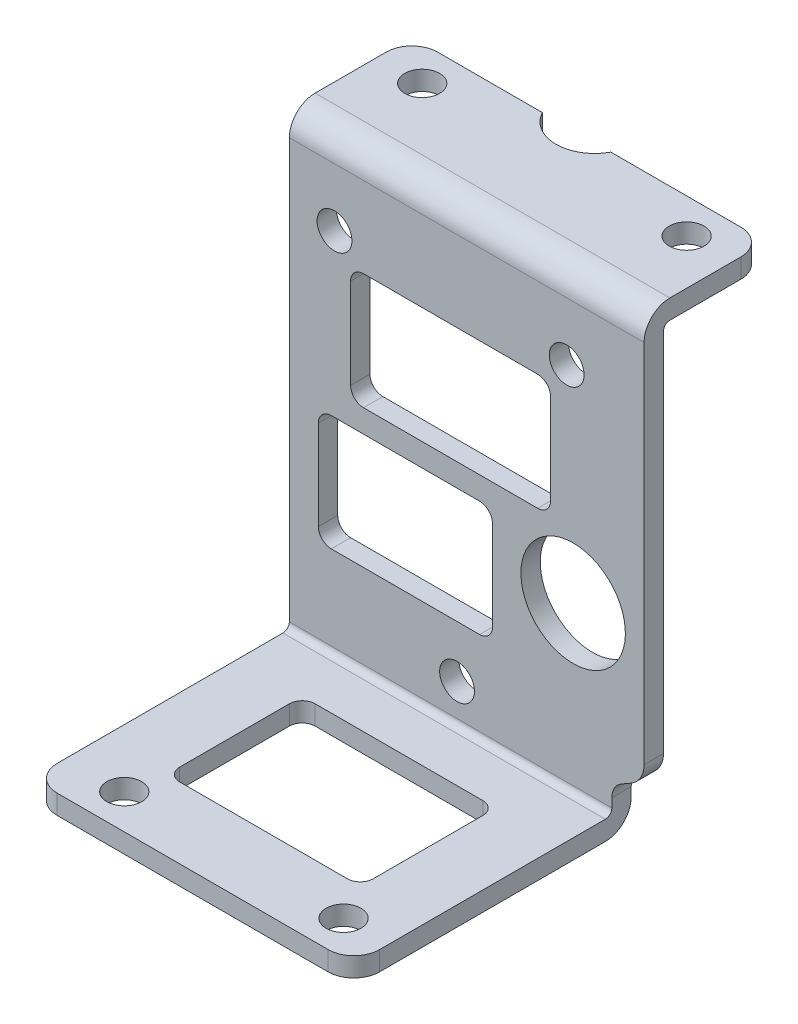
ISO-10303-21;
HEADER;
FILE_DESCRIPTION(('STEP AP214'),'2;1');
FILE_NAME('part.step','',(''),(''),'','','');
FILE_SCHEMA(('AUTOMOTIVE_DESIGN { 1 0 10303 214 1 1 1 1 }'));
ENDSEC;
DATA;
#1=APPLICATION_CONTEXT('core data for automotive mechanical design processes');
#2=APPLICATION_PROTOCOL_DEFINITION('international standard','automotive_design',2000,#1);
#3=PRODUCT_CONTEXT('',#1,'mechanical');
#4=PRODUCT('Part','Part','',(#3));
#5=PRODUCT_RELATED_PRODUCT_CATEGORY('part','',(#4));
#6=PRODUCT_DEFINITION_FORMATION('','',#4);
#7=PRODUCT_DEFINITION_CONTEXT('part definition',#1,'design');
#8=PRODUCT_DEFINITION('design','',#6,#7);
#9=PRODUCT_DEFINITION_SHAPE('','',#8);
#10=(LENGTH_UNIT() NAMED_UNIT(*) SI_UNIT(.MILLI.,.METRE.));
#11=(NAMED_UNIT(*) PLANE_ANGLE_UNIT() SI_UNIT($,.RADIAN.));
#12=(NAMED_UNIT(*) SI_UNIT($,.STERADIAN.) SOLID_ANGLE_UNIT());
#13=UNCERTAINTY_MEASURE_WITH_UNIT(LENGTH_MEASURE(1.E-05),#10,'distance_accuracy_value','');
#14=(GEOMETRIC_REPRESENTATION_CONTEXT(3) GLOBAL_UNCERTAINTY_ASSIGNED_CONTEXT((#13)) GLOBAL_UNIT_ASSIGNED_CONTEXT((#10,
#11,#12)) REPRESENTATION_CONTEXT('',''));
#15=CARTESIAN_POINT('',(0.,0.,0.));
#16=DIRECTION('',(0.,0.,1.));
#17=DIRECTION('',(1.,0.,0.));
#18=AXIS2_PLACEMENT_3D('',#15,#16,#17);
#19=CARTESIAN_POINT('',(-48.,18.35,-60.6));
#20=DIRECTION('',(0.,1.,0.));
#21=DIRECTION('',(0.,0.,1.));
#22=AXIS2_PLACEMENT_3D('',#19,#20,#21);
#23=CYLINDRICAL_SURFACE('',#22,2.00000000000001);
#24=DIRECTION('',(0.,1.,0.));
#25=VECTOR('',#24,1.);
#26=CARTESIAN_POINT('',(-48.,20.,-62.6));
#27=LINE('',#26,#25);
#28=CARTESIAN_POINT('',(-48.,18.5,-62.6));
#29=VERTEX_POINT('',#28);
#30=CARTESIAN_POINT('',(-48.,20.,-62.6));
#31=VERTEX_POINT('',#30);
#32=EDGE_CURVE('E497',#29,#31,#27,.T.);
#33=ORIENTED_EDGE('',*,*,#32,.F.);
#34=CARTESIAN_POINT('',(-48.,18.5,-60.6));
#35=DIRECTION('',(0.,1.,0.));
#36=DIRECTION('',(0.,0.,1.));
#37=AXIS2_PLACEMENT_3D('',#34,#35,#36);
#38=CIRCLE('',#37,2.00000000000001);
#39=CARTESIAN_POINT('',(-50.,18.5,-60.6));
#40=VERTEX_POINT('',#39);
#41=EDGE_CURVE('E604',#40,#29,#38,.F.);
#42=ORIENTED_EDGE('',*,*,#41,.F.);
#43=DIRECTION('',(0.,1.,0.));
#44=VECTOR('',#43,1.);
#45=CARTESIAN_POINT('',(-50.,18.35,-60.6));
#46=LINE('',#45,#44);
#47=CARTESIAN_POINT('',(-50.,20.,-60.6));
#48=VERTEX_POINT('',#47);
#49=EDGE_CURVE('E499',#40,#48,#46,.T.);
#50=ORIENTED_EDGE('',*,*,#49,.T.);
#51=CARTESIAN_POINT('',(-48.,20.,-60.6));
#52=DIRECTION('',(0.,1.,0.));
#53=DIRECTION('',(0.,0.,1.));
#54=AXIS2_PLACEMENT_3D('',#51,#52,#53);
#55=CIRCLE('',#54,2.00000000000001);
#56=EDGE_CURVE('E614',#31,#48,#55,.T.);
#57=ORIENTED_EDGE('',*,*,#56,.F.);
#58=EDGE_LOOP('',(#33,#42,#50,#57));
#59=FACE_BOUND('',#58,.T.);
#60=ADVANCED_FACE('F17',(#59),#23,.T.);
#61=CARTESIAN_POINT('',(-48.,20.,-62.6));
#62=DIRECTION('',(0.,0.,-1.));
#63=DIRECTION('',(-1.,0.,0.));
#64=AXIS2_PLACEMENT_3D('',#61,#62,#63);
#65=PLANE('',#64);
#66=DIRECTION('',(1.,0.,0.));
#67=VECTOR('',#66,1.);
#68=CARTESIAN_POINT('',(-50.,18.5,-62.6));
#69=LINE('',#68,#67);
#70=CARTESIAN_POINT('',(-39.8832998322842,18.5,-62.5999999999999));
#71=VERTEX_POINT('',#70);
#72=EDGE_CURVE('E603',#29,#71,#69,.T.);
#73=ORIENTED_EDGE('',*,*,#72,.F.);
#74=ORIENTED_EDGE('',*,*,#32,.T.);
#75=DIRECTION('',(1.,0.,0.));
#76=VECTOR('',#75,1.);
#77=CARTESIAN_POINT('',(-50.,20.,-62.6));
#78=LINE('',#77,#76);
#79=CARTESIAN_POINT('',(-39.8832998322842,20.,-62.5999999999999));
#80=VERTEX_POINT('',#79);
#81=EDGE_CURVE('E617',#80,#31,#78,.F.);
#82=ORIENTED_EDGE('',*,*,#81,.F.);
#83=DIRECTION('',(0.,-1.,0.));
#84=VECTOR('',#83,1.);
#85=CARTESIAN_POINT('',(-39.8832998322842,20.15,-62.5999999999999));
#86=LINE('',#85,#84);
#87=EDGE_CURVE('E495',#80,#71,#86,.T.);
#88=ORIENTED_EDGE('',*,*,#87,.T.);
#89=EDGE_LOOP('',(#73,#74,#82,#88));
#90=FACE_BOUND('',#89,.T.);
#91=ADVANCED_FACE('F1112',(#90),#65,.T.);
#92=CARTESIAN_POINT('',(-37.2299999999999,20.15,-64.));
#93=DIRECTION('',(0.,-1.,0.));
#94=DIRECTION('',(0.,0.,-1.));
#95=AXIS2_PLACEMENT_3D('',#92,#93,#94);
#96=CYLINDRICAL_SURFACE('',#95,3.);
#97=CARTESIAN_POINT('',(-37.2299999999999,20.,-64.));
#98=DIRECTION('',(0.,-1.,0.));
#99=DIRECTION('',(0.,0.,-1.));
#100=AXIS2_PLACEMENT_3D('',#97,#98,#99);
#101=CIRCLE('',#100,3.);
#102=CARTESIAN_POINT('',(-34.5767001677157,20.,-62.6));
#103=VERTEX_POINT('',#102);
#104=EDGE_CURVE('E607',#103,#80,#101,.T.);
#105=ORIENTED_EDGE('',*,*,#104,.F.);
#106=DIRECTION('',(0.,1.,0.));
#107=VECTOR('',#106,1.);
#108=CARTESIAN_POINT('',(-34.5767001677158,20.,-62.6));
#109=LINE('',#108,#107);
#110=CARTESIAN_POINT('',(-34.5767001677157,18.5,-62.6));
#111=VERTEX_POINT('',#110);
#112=EDGE_CURVE('E493',#111,#103,#109,.T.);
#113=ORIENTED_EDGE('',*,*,#112,.F.);
#114=CARTESIAN_POINT('',(-37.2299999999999,18.5,-64.));
#115=DIRECTION('',(0.,-1.,0.));
#116=DIRECTION('',(0.,0.,-1.));
#117=AXIS2_PLACEMENT_3D('',#114,#115,#116);
#118=CIRCLE('',#117,3.);
#119=EDGE_CURVE('E600',#71,#111,#118,.F.);
#120=ORIENTED_EDGE('',*,*,#119,.F.);
#121=ORIENTED_EDGE('',*,*,#87,.F.);
#122=EDGE_LOOP('',(#105,#113,#120,#121));
#123=FACE_BOUND('',#122,.T.);
#124=ADVANCED_FACE('F1104',(#123),#96,.F.);
#125=CARTESIAN_POINT('',(-34.576700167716,20.,-62.6));
#126=DIRECTION('',(0.,0.,-1.));
#127=DIRECTION('',(-1.,0.,0.));
#128=AXIS2_PLACEMENT_3D('',#125,#126,#127);
#129=PLANE('',#128);
#130=DIRECTION('',(1.,0.,0.));
#131=VECTOR('',#130,1.);
#132=CARTESIAN_POINT('',(-50.,18.5,-62.6));
#133=LINE('',#132,#131);
#134=CARTESIAN_POINT('',(-24.5,18.5,-62.6));
#135=VERTEX_POINT('',#134);
#136=EDGE_CURVE('E599',#111,#135,#133,.T.);
#137=ORIENTED_EDGE('',*,*,#136,.F.);
#138=ORIENTED_EDGE('',*,*,#112,.T.);
#139=DIRECTION('',(1.,0.,0.));
#140=VECTOR('',#139,1.);
#141=CARTESIAN_POINT('',(-50.,20.,-62.6));
#142=LINE('',#141,#140);
#143=CARTESIAN_POINT('',(-24.5,20.,-62.6));
#144=VERTEX_POINT('',#143);
#145=EDGE_CURVE('E610',#144,#103,#142,.F.);
#146=ORIENTED_EDGE('',*,*,#145,.F.);
#147=DIRECTION('',(0.,1.,0.));
#148=VECTOR('',#147,1.);
#149=CARTESIAN_POINT('',(-24.5,18.35,-62.6));
#150=LINE('',#149,#148);
#151=EDGE_CURVE('E491',#135,#144,#150,.T.);
#152=ORIENTED_EDGE('',*,*,#151,.F.);
#153=EDGE_LOOP('',(#137,#138,#146,#152));
#154=FACE_BOUND('',#153,.T.);
#155=ADVANCED_FACE('F1096',(#154),#129,.T.);
#156=CARTESIAN_POINT('',(-24.5,18.35,-60.6));
#157=DIRECTION('',(0.,1.,0.));
#158=DIRECTION('',(0.,0.,1.));
#159=AXIS2_PLACEMENT_3D('',#156,#157,#158);
#160=CYLINDRICAL_SURFACE('',#159,2.);
#161=DIRECTION('',(0.,1.,0.));
#162=VECTOR('',#161,1.);
#163=CARTESIAN_POINT('',(-22.5,18.35,-60.59999975));
#164=LINE('',#163,#162);
#165=CARTESIAN_POINT('',(-22.5,20.,-60.599999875));
#166=VERTEX_POINT('',#165);
#167=CARTESIAN_POINT('',(-22.5,18.5,-60.599999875));
#168=VERTEX_POINT('',#167);
#169=EDGE_CURVE('E277',#166,#168,#164,.F.);
#170=ORIENTED_EDGE('',*,*,#169,.T.);
#171=CARTESIAN_POINT('',(-24.5,18.5,-60.6));
#172=DIRECTION('',(0.,1.,0.));
#173=DIRECTION('',(0.,0.,1.));
#174=AXIS2_PLACEMENT_3D('',#171,#172,#173);
#175=CIRCLE('',#174,2.);
#176=EDGE_CURVE('E432',#135,#168,#175,.F.);
#177=ORIENTED_EDGE('',*,*,#176,.F.);
#178=ORIENTED_EDGE('',*,*,#151,.T.);
#179=CARTESIAN_POINT('',(-24.5,20.,-60.6));
#180=DIRECTION('',(0.,1.,0.));
#181=DIRECTION('',(0.,0.,1.));
#182=AXIS2_PLACEMENT_3D('',#179,#180,#181);
#183=CIRCLE('',#182,2.);
#184=EDGE_CURVE('E611',#166,#144,#183,.T.);
#185=ORIENTED_EDGE('',*,*,#184,.F.);
#186=EDGE_LOOP('',(#170,#177,#178,#185));
#187=FACE_BOUND('',#186,.T.);
#188=ADVANCED_FACE('F1088',(#187),#160,.T.);
#189=CARTESIAN_POINT('',(-26.,20.15,-59.9));
#190=DIRECTION('',(0.,-1.,0.));
#191=DIRECTION('',(0.,0.,-1.));
#192=AXIS2_PLACEMENT_3D('',#189,#190,#191);
#193=CYLINDRICAL_SURFACE('',#192,1.35);
#194=CARTESIAN_POINT('',(-26.,20.,-59.9));
#195=DIRECTION('',(0.,-1.,0.));
#196=DIRECTION('',(0.,0.,-1.));
#197=AXIS2_PLACEMENT_3D('',#194,#195,#196);
#198=CIRCLE('',#197,1.35);
#199=CARTESIAN_POINT('',(-26.,20.,-61.25));
#200=VERTEX_POINT('',#199);
#201=EDGE_CURVE('E621',#200,#200,#198,.T.);
#202=ORIENTED_EDGE('',*,*,#201,.F.);
#203=EDGE_LOOP('',(#202));
#204=FACE_BOUND('',#203,.T.);
#205=CARTESIAN_POINT('',(-26.,18.5,-59.9));
#206=DIRECTION('',(0.,-1.,0.));
#207=DIRECTION('',(0.,0.,-1.));
#208=AXIS2_PLACEMENT_3D('',#205,#206,#207);
#209=CIRCLE('',#208,1.35);
#210=CARTESIAN_POINT('',(-26.,18.5,-61.25));
#211=VERTEX_POINT('',#210);
#212=EDGE_CURVE('E431',#211,#211,#209,.F.);
#213=ORIENTED_EDGE('',*,*,#212,.F.);
#214=EDGE_LOOP('',(#213));
#215=FACE_BOUND('',#214,.T.);
#216=ADVANCED_FACE('F1080',(#204,#215),#193,.F.);
#217=CARTESIAN_POINT('',(-46.5,20.15,-59.9));
#218=DIRECTION('',(0.,-1.,0.));
#219=DIRECTION('',(0.,0.,-1.));
#220=AXIS2_PLACEMENT_3D('',#217,#218,#219);
#221=CYLINDRICAL_SURFACE('',#220,1.35);
#222=CARTESIAN_POINT('',(-46.5,20.,-59.9));
#223=DIRECTION('',(0.,-1.,0.));
#224=DIRECTION('',(0.,0.,-1.));
#225=AXIS2_PLACEMENT_3D('',#222,#223,#224);
#226=CIRCLE('',#225,1.35);
#227=CARTESIAN_POINT('',(-46.5,20.,-61.25));
#228=VERTEX_POINT('',#227);
#229=EDGE_CURVE('E618',#228,#228,#226,.T.);
#230=ORIENTED_EDGE('',*,*,#229,.F.);
#231=EDGE_LOOP('',(#230));
#232=FACE_BOUND('',#231,.T.);
#233=CARTESIAN_POINT('',(-46.5,18.5,-59.9));
#234=DIRECTION('',(0.,-1.,0.));
#235=DIRECTION('',(0.,0.,-1.));
#236=AXIS2_PLACEMENT_3D('',#233,#234,#235);
#237=CIRCLE('',#236,1.35);
#238=CARTESIAN_POINT('',(-46.5,18.5,-61.25));
#239=VERTEX_POINT('',#238);
#240=EDGE_CURVE('E592',#239,#239,#237,.F.);
#241=ORIENTED_EDGE('',*,*,#240,.F.);
#242=EDGE_LOOP('',(#241));
#243=FACE_BOUND('',#242,.T.);
#244=ADVANCED_FACE('F1073',(#232,#243),#221,.F.);
#245=CARTESIAN_POINT('',(-22.5,18.,-55.1));
#246=DIRECTION('',(-1.,0.,0.));
#247=DIRECTION('',(0.,0.,1.));
#248=AXIS2_PLACEMENT_3D('',#245,#246,#247);
#249=CYLINDRICAL_SURFACE('',#248,0.5);
#250=CARTESIAN_POINT('',(-22.5,18.,-55.1));
#251=DIRECTION('',(-1.,0.,0.));
#252=DIRECTION('',(0.,0.,1.));
#253=AXIS2_PLACEMENT_3D('',#250,#251,#252);
#254=CIRCLE('',#253,0.5);
#255=CARTESIAN_POINT('',(-22.5,18.,-54.6));
#256=VERTEX_POINT('',#255);
#257=CARTESIAN_POINT('',(-22.5,18.5,-55.1));
#258=VERTEX_POINT('',#257);
#259=EDGE_CURVE('E276',#256,#258,#254,.T.);
#260=ORIENTED_EDGE('',*,*,#259,.F.);
#261=DIRECTION('',(-1.,0.,0.));
#262=VECTOR('',#261,1.);
#263=CARTESIAN_POINT('',(-50.,18.,-54.6));
#264=LINE('',#263,#262);
#265=CARTESIAN_POINT('',(-50.,18.,-54.6));
#266=VERTEX_POINT('',#265);
#267=EDGE_CURVE('E279',#266,#256,#264,.F.);
#268=ORIENTED_EDGE('',*,*,#267,.F.);
#269=CARTESIAN_POINT('',(-50.,18.,-55.1));
#270=DIRECTION('',(-1.,0.,0.));
#271=DIRECTION('',(0.,0.,1.));
#272=AXIS2_PLACEMENT_3D('',#269,#270,#271);
#273=CIRCLE('',#272,0.5);
#274=CARTESIAN_POINT('',(-50.,18.5,-55.1));
#275=VERTEX_POINT('',#274);
#276=EDGE_CURVE('E21',#275,#266,#273,.F.);
#277=ORIENTED_EDGE('',*,*,#276,.F.);
#278=DIRECTION('',(1.,0.,0.));
#279=VECTOR('',#278,1.);
#280=CARTESIAN_POINT('',(-50.,18.5,-55.1));
#281=LINE('',#280,#279);
#282=EDGE_CURVE('E429',#258,#275,#281,.F.);
#283=ORIENTED_EDGE('',*,*,#282,.F.);
#284=EDGE_LOOP('',(#260,#268,#277,#283));
#285=FACE_BOUND('',#284,.T.);
#286=ADVANCED_FACE('F280',(#285),#249,.F.);
#287=CARTESIAN_POINT('',(-31.,-14.85,-48.1));
#288=DIRECTION('',(0.,-1.,0.));
#289=DIRECTION('',(0.,0.,-1.));
#290=AXIS2_PLACEMENT_3D('',#287,#288,#289);
#291=CYLINDRICAL_SURFACE('',#290,1.);
#292=DIRECTION('',(0.,1.,0.));
#293=VECTOR('',#292,1.);
#294=CARTESIAN_POINT('',(-31.,-15.,-49.1));
#295=LINE('',#294,#293);
#296=CARTESIAN_POINT('',(-31.,-16.5,-49.1));
#297=VERTEX_POINT('',#296);
#298=CARTESIAN_POINT('',(-31.,-15.,-49.1));
#299=VERTEX_POINT('',#298);
#300=EDGE_CURVE('E472',#297,#299,#295,.T.);
#301=ORIENTED_EDGE('',*,*,#300,.F.);
#302=CARTESIAN_POINT('',(-31.,-16.5,-48.1));
#303=DIRECTION('',(0.,-1.,0.));
#304=DIRECTION('',(0.,0.,-1.));
#305=AXIS2_PLACEMENT_3D('',#302,#303,#304);
#306=CIRCLE('',#305,1.);
#307=CARTESIAN_POINT('',(-30.,-16.5,-48.1));
#308=VERTEX_POINT('',#307);
#309=EDGE_CURVE('E637',#308,#297,#306,.F.);
#310=ORIENTED_EDGE('',*,*,#309,.F.);
#311=DIRECTION('',(0.,1.,0.));
#312=VECTOR('',#311,1.);
#313=CARTESIAN_POINT('',(-30.,-15.,-48.1));
#314=LINE('',#313,#312);
#315=CARTESIAN_POINT('',(-30.,-15.,-48.1));
#316=VERTEX_POINT('',#315);
#317=EDGE_CURVE('E484',#316,#308,#314,.F.);
#318=ORIENTED_EDGE('',*,*,#317,.F.);
#319=CARTESIAN_POINT('',(-31.,-15.,-48.1));
#320=DIRECTION('',(0.,-1.,0.));
#321=DIRECTION('',(0.,0.,-1.));
#322=AXIS2_PLACEMENT_3D('',#319,#320,#321);
#323=CIRCLE('',#322,1.);
#324=EDGE_CURVE('E284',#299,#316,#323,.T.);
#325=ORIENTED_EDGE('',*,*,#324,.F.);
#326=EDGE_LOOP('',(#301,#310,#318,#325));
#327=FACE_BOUND('',#326,.T.);
#328=ADVANCED_FACE('F1058',(#327),#291,.F.);
#329=CARTESIAN_POINT('',(-30.,-15.,-48.1));
#330=DIRECTION('',(-1.,0.,0.));
#331=DIRECTION('',(0.,0.,1.));
#332=AXIS2_PLACEMENT_3D('',#329,#330,#331);
#333=PLANE('',#332);
#334=DIRECTION('',(0.,1.,0.));
#335=VECTOR('',#334,1.);
#336=CARTESIAN_POINT('',(-30.,-15.,-39.6));
#337=LINE('',#336,#335);
#338=CARTESIAN_POINT('',(-30.,-16.5,-39.6));
#339=VERTEX_POINT('',#338);
#340=CARTESIAN_POINT('',(-30.,-15.,-39.6));
#341=VERTEX_POINT('',#340);
#342=EDGE_CURVE('E483',#339,#341,#337,.T.);
#343=ORIENTED_EDGE('',*,*,#342,.T.);
#344=DIRECTION('',(0.,0.,1.));
#345=VECTOR('',#344,1.);
#346=CARTESIAN_POINT('',(-30.,-15.,-52.6));
#347=LINE('',#346,#345);
#348=EDGE_CURVE('E586',#316,#341,#347,.T.);
#349=ORIENTED_EDGE('',*,*,#348,.F.);
#350=ORIENTED_EDGE('',*,*,#317,.T.);
#351=DIRECTION('',(0.,0.,-1.));
#352=VECTOR('',#351,1.);
#353=CARTESIAN_POINT('',(-30.,-16.5,-52.6));
#354=LINE('',#353,#352);
#355=EDGE_CURVE('E624',#339,#308,#354,.T.);
#356=ORIENTED_EDGE('',*,*,#355,.F.);
#357=EDGE_LOOP('',(#343,#349,#350,#356));
#358=FACE_BOUND('',#357,.T.);
#359=ADVANCED_FACE('F1050',(#358),#333,.T.);
#360=CARTESIAN_POINT('',(-31.,-14.85,-39.6));
#361=DIRECTION('',(0.,-1.,0.));
#362=DIRECTION('',(1.,0.,0.));
#363=AXIS2_PLACEMENT_3D('',#360,#361,#362);
#364=CYLINDRICAL_SURFACE('',#363,0.999999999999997);
#365=ORIENTED_EDGE('',*,*,#342,.F.);
#366=CARTESIAN_POINT('',(-31.,-16.5,-39.6));
#367=DIRECTION('',(0.,-1.,0.));
#368=DIRECTION('',(1.,0.,0.));
#369=AXIS2_PLACEMENT_3D('',#366,#367,#368);
#370=CIRCLE('',#369,0.999999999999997);
#371=CARTESIAN_POINT('',(-31.,-16.5,-38.6));
#372=VERTEX_POINT('',#371);
#373=EDGE_CURVE('E625',#372,#339,#370,.F.);
#374=ORIENTED_EDGE('',*,*,#373,.F.);
#375=DIRECTION('',(0.,1.,0.));
#376=VECTOR('',#375,1.);
#377=CARTESIAN_POINT('',(-31.,-15.,-38.6));
#378=LINE('',#377,#376);
#379=CARTESIAN_POINT('',(-31.,-15.,-38.6));
#380=VERTEX_POINT('',#379);
#381=EDGE_CURVE('E481',#380,#372,#378,.F.);
#382=ORIENTED_EDGE('',*,*,#381,.F.);
#383=CARTESIAN_POINT('',(-31.,-15.,-39.6));
#384=DIRECTION('',(0.,-1.,0.));
#385=DIRECTION('',(1.,0.,0.));
#386=AXIS2_PLACEMENT_3D('',#383,#384,#385);
#387=CIRCLE('',#386,0.999999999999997);
#388=EDGE_CURVE('E583',#341,#380,#387,.T.);
#389=ORIENTED_EDGE('',*,*,#388,.F.);
#390=EDGE_LOOP('',(#365,#374,#382,#389));
#391=FACE_BOUND('',#390,.T.);
#392=ADVANCED_FACE('F1042',(#391),#364,.F.);
#393=CARTESIAN_POINT('',(-31.,-15.,-38.6));
#394=DIRECTION('',(0.,0.,-1.));
#395=DIRECTION('',(-1.,0.,0.));
#396=AXIS2_PLACEMENT_3D('',#393,#394,#395);
#397=PLANE('',#396);
#398=DIRECTION('',(0.,-1.,0.));
#399=VECTOR('',#398,1.);
#400=CARTESIAN_POINT('',(-44.,-14.85,-38.6));
#401=LINE('',#400,#399);
#402=CARTESIAN_POINT('',(-44.,-16.5,-38.6));
#403=VERTEX_POINT('',#402);
#404=CARTESIAN_POINT('',(-44.,-15.,-38.6));
#405=VERTEX_POINT('',#404);
#406=EDGE_CURVE('E479',#403,#405,#401,.F.);
#407=ORIENTED_EDGE('',*,*,#406,.T.);
#408=DIRECTION('',(1.,0.,0.));
#409=VECTOR('',#408,1.);
#410=CARTESIAN_POINT('',(-50.,-15.,-38.6));
#411=LINE('',#410,#409);
#412=EDGE_CURVE('E582',#380,#405,#411,.F.);
#413=ORIENTED_EDGE('',*,*,#412,.F.);
#414=ORIENTED_EDGE('',*,*,#381,.T.);
#415=DIRECTION('',(1.,0.,0.));
#416=VECTOR('',#415,1.);
#417=CARTESIAN_POINT('',(-50.,-16.5,-38.6));
#418=LINE('',#417,#416);
#419=EDGE_CURVE('E628',#403,#372,#418,.T.);
#420=ORIENTED_EDGE('',*,*,#419,.F.);
#421=EDGE_LOOP('',(#407,#413,#414,#420));
#422=FACE_BOUND('',#421,.T.);
#423=ADVANCED_FACE('F1034',(#422),#397,.T.);
#424=CARTESIAN_POINT('',(-44.,-14.85,-39.6));
#425=DIRECTION('',(0.,-1.,0.));
#426=DIRECTION('',(1.,0.,0.));
#427=AXIS2_PLACEMENT_3D('',#424,#425,#426);
#428=CYLINDRICAL_SURFACE('',#427,1.);
#429=ORIENTED_EDGE('',*,*,#406,.F.);
#430=CARTESIAN_POINT('',(-44.,-16.5,-39.6));
#431=DIRECTION('',(0.,-1.,0.));
#432=DIRECTION('',(1.,0.,0.));
#433=AXIS2_PLACEMENT_3D('',#430,#431,#432);
#434=CIRCLE('',#433,1.);
#435=CARTESIAN_POINT('',(-45.,-16.5,-39.6));
#436=VERTEX_POINT('',#435);
#437=EDGE_CURVE('E629',#436,#403,#434,.F.);
#438=ORIENTED_EDGE('',*,*,#437,.F.);
#439=DIRECTION('',(0.,1.,0.));
#440=VECTOR('',#439,1.);
#441=CARTESIAN_POINT('',(-45.,-15.,-39.6));
#442=LINE('',#441,#440);
#443=CARTESIAN_POINT('',(-45.,-15.,-39.6));
#444=VERTEX_POINT('',#443);
#445=EDGE_CURVE('E477',#444,#436,#442,.F.);
#446=ORIENTED_EDGE('',*,*,#445,.F.);
#447=CARTESIAN_POINT('',(-44.,-15.,-39.6));
#448=DIRECTION('',(0.,-1.,0.));
#449=DIRECTION('',(1.,0.,0.));
#450=AXIS2_PLACEMENT_3D('',#447,#448,#449);
#451=CIRCLE('',#450,1.);
#452=EDGE_CURVE('E579',#405,#444,#451,.T.);
#453=ORIENTED_EDGE('',*,*,#452,.F.);
#454=EDGE_LOOP('',(#429,#438,#446,#453));
#455=FACE_BOUND('',#454,.T.);
#456=ADVANCED_FACE('F1026',(#455),#428,.F.);
#457=CARTESIAN_POINT('',(-45.,-15.,-39.6));
#458=DIRECTION('',(1.,0.,0.));
#459=DIRECTION('',(0.,0.,-1.));
#460=AXIS2_PLACEMENT_3D('',#457,#458,#459);
#461=PLANE('',#460);
#462=DIRECTION('',(0.,-1.,0.));
#463=VECTOR('',#462,1.);
#464=CARTESIAN_POINT('',(-45.,-14.85,-48.1));
#465=LINE('',#464,#463);
#466=CARTESIAN_POINT('',(-45.,-16.5,-48.1));
#467=VERTEX_POINT('',#466);
#468=CARTESIAN_POINT('',(-45.,-15.,-48.1));
#469=VERTEX_POINT('',#468);
#470=EDGE_CURVE('E475',#467,#469,#465,.F.);
#471=ORIENTED_EDGE('',*,*,#470,.T.);
#472=DIRECTION('',(0.,0.,1.));
#473=VECTOR('',#472,1.);
#474=CARTESIAN_POINT('',(-45.,-15.,-52.6));
#475=LINE('',#474,#473);
#476=EDGE_CURVE('E578',#444,#469,#475,.F.);
#477=ORIENTED_EDGE('',*,*,#476,.F.);
#478=ORIENTED_EDGE('',*,*,#445,.T.);
#479=DIRECTION('',(0.,0.,-1.));
#480=VECTOR('',#479,1.);
#481=CARTESIAN_POINT('',(-45.,-16.5,-52.6));
#482=LINE('',#481,#480);
#483=EDGE_CURVE('E632',#467,#436,#482,.F.);
#484=ORIENTED_EDGE('',*,*,#483,.F.);
#485=EDGE_LOOP('',(#471,#477,#478,#484));
#486=FACE_BOUND('',#485,.T.);
#487=ADVANCED_FACE('F1018',(#486),#461,.T.);
#488=CARTESIAN_POINT('',(-44.,-14.85,-48.1));
#489=DIRECTION('',(0.,-1.,0.));
#490=DIRECTION('',(0.,0.,-1.));
#491=AXIS2_PLACEMENT_3D('',#488,#489,#490);
#492=CYLINDRICAL_SURFACE('',#491,1.00000000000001);
#493=ORIENTED_EDGE('',*,*,#470,.F.);
#494=CARTESIAN_POINT('',(-44.,-16.5,-48.1));
#495=DIRECTION('',(0.,-1.,0.));
#496=DIRECTION('',(0.,0.,-1.));
#497=AXIS2_PLACEMENT_3D('',#494,#495,#496);
#498=CIRCLE('',#497,1.00000000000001);
#499=CARTESIAN_POINT('',(-44.,-16.5,-49.1));
#500=VERTEX_POINT('',#499);
#501=EDGE_CURVE('E633',#500,#467,#498,.F.);
#502=ORIENTED_EDGE('',*,*,#501,.F.);
#503=DIRECTION('',(0.,1.,0.));
#504=VECTOR('',#503,1.);
#505=CARTESIAN_POINT('',(-44.,-15.,-49.1));
#506=LINE('',#505,#504);
#507=CARTESIAN_POINT('',(-44.,-15.,-49.1));
#508=VERTEX_POINT('',#507);
#509=EDGE_CURVE('E473',#508,#500,#506,.F.);
#510=ORIENTED_EDGE('',*,*,#509,.F.);
#511=CARTESIAN_POINT('',(-44.,-15.,-48.1));
#512=DIRECTION('',(0.,-1.,0.));
#513=DIRECTION('',(0.,0.,-1.));
#514=AXIS2_PLACEMENT_3D('',#511,#512,#513);
#515=CIRCLE('',#514,1.00000000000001);
#516=EDGE_CURVE('E575',#469,#508,#515,.T.);
#517=ORIENTED_EDGE('',*,*,#516,.F.);
#518=EDGE_LOOP('',(#493,#502,#510,#517));
#519=FACE_BOUND('',#518,.T.);
#520=ADVANCED_FACE('F1010',(#519),#492,.F.);
#521=CARTESIAN_POINT('',(-44.,-15.,-49.1));
#522=DIRECTION('',(0.,0.,1.));
#523=DIRECTION('',(1.,0.,0.));
#524=AXIS2_PLACEMENT_3D('',#521,#522,#523);
#525=PLANE('',#524);
#526=ORIENTED_EDGE('',*,*,#300,.T.);
#527=DIRECTION('',(1.,0.,0.));
#528=VECTOR('',#527,1.);
#529=CARTESIAN_POINT('',(-50.,-15.,-49.1));
#530=LINE('',#529,#528);
#531=EDGE_CURVE('E574',#508,#299,#530,.T.);
#532=ORIENTED_EDGE('',*,*,#531,.F.);
#533=ORIENTED_EDGE('',*,*,#509,.T.);
#534=DIRECTION('',(1.,0.,0.));
#535=VECTOR('',#534,1.);
#536=CARTESIAN_POINT('',(-50.,-16.5,-49.1));
#537=LINE('',#536,#535);
#538=EDGE_CURVE('E636',#297,#500,#537,.F.);
#539=ORIENTED_EDGE('',*,*,#538,.F.);
#540=EDGE_LOOP('',(#526,#532,#533,#539));
#541=FACE_BOUND('',#540,.T.);
#542=ADVANCED_FACE('F1002',(#541),#525,.T.);
#543=CARTESIAN_POINT('',(-28.5,-14.85,-35.8));
#544=DIRECTION('',(0.,-1.,0.));
#545=DIRECTION('',(0.,0.,-1.));
#546=AXIS2_PLACEMENT_3D('',#543,#544,#545);
#547=CYLINDRICAL_SURFACE('',#546,1.35);
#548=CARTESIAN_POINT('',(-28.5,-15.,-35.8));
#549=DIRECTION('',(0.,-1.,0.));
#550=DIRECTION('',(0.,0.,-1.));
#551=AXIS2_PLACEMENT_3D('',#548,#549,#550);
#552=CIRCLE('',#551,1.35);
#553=CARTESIAN_POINT('',(-28.5,-15.,-37.15));
#554=VERTEX_POINT('',#553);
#555=EDGE_CURVE('E571',#554,#554,#552,.T.);
#556=ORIENTED_EDGE('',*,*,#555,.F.);
#557=EDGE_LOOP('',(#556));
#558=FACE_BOUND('',#557,.T.);
#559=CARTESIAN_POINT('',(-28.5,-16.5,-35.8));
#560=DIRECTION('',(0.,-1.,0.));
#561=DIRECTION('',(0.,0.,-1.));
#562=AXIS2_PLACEMENT_3D('',#559,#560,#561);
#563=CIRCLE('',#562,1.35);
#564=CARTESIAN_POINT('',(-28.5,-16.5,-37.15));
#565=VERTEX_POINT('',#564);
#566=EDGE_CURVE('E643',#565,#565,#563,.F.);
#567=ORIENTED_EDGE('',*,*,#566,.F.);
#568=EDGE_LOOP('',(#567));
#569=FACE_BOUND('',#568,.T.);
#570=ADVANCED_FACE('F994',(#558,#569),#547,.F.);
#571=CARTESIAN_POINT('',(-45.5,-14.85,-35.8));
#572=DIRECTION('',(0.,-1.,0.));
#573=DIRECTION('',(0.,0.,-1.));
#574=AXIS2_PLACEMENT_3D('',#571,#572,#573);
#575=CYLINDRICAL_SURFACE('',#574,1.35);
#576=CARTESIAN_POINT('',(-45.5,-15.,-35.8));
#577=DIRECTION('',(0.,-1.,0.));
#578=DIRECTION('',(0.,0.,-1.));
#579=AXIS2_PLACEMENT_3D('',#576,#577,#578);
#580=CIRCLE('',#579,1.35);
#581=CARTESIAN_POINT('',(-45.5,-15.,-37.15));
#582=VERTEX_POINT('',#581);
#583=EDGE_CURVE('E568',#582,#582,#580,.T.);
#584=ORIENTED_EDGE('',*,*,#583,.F.);
#585=EDGE_LOOP('',(#584));
#586=FACE_BOUND('',#585,.T.);
#587=CARTESIAN_POINT('',(-45.5,-16.5,-35.8));
#588=DIRECTION('',(0.,-1.,0.));
#589=DIRECTION('',(0.,0.,-1.));
#590=AXIS2_PLACEMENT_3D('',#587,#588,#589);
#591=CIRCLE('',#590,1.35);
#592=CARTESIAN_POINT('',(-45.5,-16.5,-37.15));
#593=VERTEX_POINT('',#592);
#594=EDGE_CURVE('E640',#593,#593,#591,.F.);
#595=ORIENTED_EDGE('',*,*,#594,.F.);
#596=EDGE_LOOP('',(#595));
#597=FACE_BOUND('',#596,.T.);
#598=ADVANCED_FACE('F986',(#586,#597),#575,.F.);
#599=CARTESIAN_POINT('',(-48.,-16.65,-35.1));
#600=DIRECTION('',(0.,1.,0.));
#601=DIRECTION('',(-1.,0.,0.));
#602=AXIS2_PLACEMENT_3D('',#599,#600,#601);
#603=CYLINDRICAL_SURFACE('',#602,2.);
#604=DIRECTION('',(0.,1.,0.));
#605=VECTOR('',#604,1.);
#606=CARTESIAN_POINT('',(-50.,-16.65,-35.1));
#607=LINE('',#606,#605);
#608=CARTESIAN_POINT('',(-50.,-15.,-35.1));
#609=VERTEX_POINT('',#608);
#610=CARTESIAN_POINT('',(-50.,-16.5,-35.1));
#611=VERTEX_POINT('',#610);
#612=EDGE_CURVE('E470',#609,#611,#607,.F.);
#613=ORIENTED_EDGE('',*,*,#612,.T.);
#614=CARTESIAN_POINT('',(-48.,-16.5,-35.1));
#615=DIRECTION('',(0.,1.,0.));
#616=DIRECTION('',(-1.,0.,0.));
#617=AXIS2_PLACEMENT_3D('',#614,#615,#616);
#618=CIRCLE('',#617,2.);
#619=CARTESIAN_POINT('',(-48.,-16.5,-33.1));
#620=VERTEX_POINT('',#619);
#621=EDGE_CURVE('E440',#620,#611,#618,.F.);
#622=ORIENTED_EDGE('',*,*,#621,.F.);
#623=DIRECTION('',(0.,1.,0.));
#624=VECTOR('',#623,1.);
#625=CARTESIAN_POINT('',(-48.,-15.,-33.1));
#626=LINE('',#625,#624);
#627=CARTESIAN_POINT('',(-48.,-15.,-33.1));
#628=VERTEX_POINT('',#627);
#629=EDGE_CURVE('E468',#628,#620,#626,.F.);
#630=ORIENTED_EDGE('',*,*,#629,.F.);
#631=CARTESIAN_POINT('',(-48.,-15.,-35.1));
#632=DIRECTION('',(0.,1.,0.));
#633=DIRECTION('',(-1.,0.,0.));
#634=AXIS2_PLACEMENT_3D('',#631,#632,#633);
#635=CIRCLE('',#634,2.);
#636=EDGE_CURVE('E565',#609,#628,#635,.T.);
#637=ORIENTED_EDGE('',*,*,#636,.F.);
#638=EDGE_LOOP('',(#613,#622,#630,#637));
#639=FACE_BOUND('',#638,.T.);
#640=ADVANCED_FACE('F978',(#639),#603,.T.);
#641=CARTESIAN_POINT('',(-48.,-15.,-33.1));
#642=DIRECTION('',(0.,0.,1.));
#643=DIRECTION('',(1.,0.,0.));
#644=AXIS2_PLACEMENT_3D('',#641,#642,#643);
#645=PLANE('',#644);
#646=DIRECTION('',(0.,1.,0.));
#647=VECTOR('',#646,1.);
#648=CARTESIAN_POINT('',(-27.00000025,-16.65,-33.1));
#649=LINE('',#648,#647);
#650=CARTESIAN_POINT('',(-27.000000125,-15.,-33.1));
#651=VERTEX_POINT('',#650);
#652=CARTESIAN_POINT('',(-27.000000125,-16.5,-33.1));
#653=VERTEX_POINT('',#652);
#654=EDGE_CURVE('E464',#651,#653,#649,.F.);
#655=ORIENTED_EDGE('',*,*,#654,.F.);
#656=DIRECTION('',(1.,0.,0.));
#657=VECTOR('',#656,1.);
#658=CARTESIAN_POINT('',(-50.,-15.,-33.1));
#659=LINE('',#658,#657);
#660=EDGE_CURVE('E564',#628,#651,#659,.T.);
#661=ORIENTED_EDGE('',*,*,#660,.F.);
#662=ORIENTED_EDGE('',*,*,#629,.T.);
#663=DIRECTION('',(1.,0.,0.));
#664=VECTOR('',#663,1.);
#665=CARTESIAN_POINT('',(-50.,-16.5,-33.1));
#666=LINE('',#665,#664);
#667=EDGE_CURVE('E651',#653,#620,#666,.F.);
#668=ORIENTED_EDGE('',*,*,#667,.F.);
#669=EDGE_LOOP('',(#655,#661,#662,#668));
#670=FACE_BOUND('',#669,.T.);
#671=ADVANCED_FACE('F970',(#670),#645,.T.);
#672=CARTESIAN_POINT('',(-27.,-16.65,-35.1));
#673=DIRECTION('',(0.,1.,0.));
#674=DIRECTION('',(-1.,0.,0.));
#675=AXIS2_PLACEMENT_3D('',#672,#673,#674);
#676=CYLINDRICAL_SURFACE('',#675,1.99999999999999);
#677=ORIENTED_EDGE('',*,*,#654,.T.);
#678=CARTESIAN_POINT('',(-27.,-16.5,-35.1));
#679=DIRECTION('',(0.,1.,0.));
#680=DIRECTION('',(-1.,0.,0.));
#681=AXIS2_PLACEMENT_3D('',#678,#679,#680);
#682=CIRCLE('',#681,1.99999999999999);
#683=CARTESIAN_POINT('',(-25.,-16.5,-35.1));
#684=VERTEX_POINT('',#683);
#685=EDGE_CURVE('E646',#684,#653,#682,.F.);
#686=ORIENTED_EDGE('',*,*,#685,.F.);
#687=DIRECTION('',(0.,1.,0.));
#688=VECTOR('',#687,1.);
#689=CARTESIAN_POINT('',(-25.,-16.512,-35.1));
#690=LINE('',#689,#688);
#691=CARTESIAN_POINT('',(-25.,-15.,-35.1));
#692=VERTEX_POINT('',#691);
#693=EDGE_CURVE('E460',#692,#684,#690,.F.);
#694=ORIENTED_EDGE('',*,*,#693,.F.);
#695=CARTESIAN_POINT('',(-27.,-15.,-35.1));
#696=DIRECTION('',(0.,1.,0.));
#697=DIRECTION('',(-1.,0.,0.));
#698=AXIS2_PLACEMENT_3D('',#695,#696,#697);
#699=CIRCLE('',#698,1.99999999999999);
#700=EDGE_CURVE('E561',#651,#692,#699,.T.);
#701=ORIENTED_EDGE('',*,*,#700,.F.);
#702=EDGE_LOOP('',(#677,#686,#694,#701));
#703=FACE_BOUND('',#702,.T.);
#704=ADVANCED_FACE('F963',(#703),#676,.T.);
#705=CARTESIAN_POINT('',(-25.,-16.512,-52.6));
#706=DIRECTION('',(1.,0.,0.));
#707=DIRECTION('',(0.,0.,-1.));
#708=AXIS2_PLACEMENT_3D('',#705,#706,#707);
#709=PLANE('',#708);
#710=ORIENTED_EDGE('',*,*,#693,.T.);
#711=DIRECTION('',(0.,0.,-1.));
#712=VECTOR('',#711,1.);
#713=CARTESIAN_POINT('',(-25.,-16.5,-52.6));
#714=LINE('',#713,#712);
#715=CARTESIAN_POINT('',(-25.,-16.5,-52.6));
#716=VERTEX_POINT('',#715);
#717=EDGE_CURVE('E439',#716,#684,#714,.F.);
#718=ORIENTED_EDGE('',*,*,#717,.F.);
#719=CARTESIAN_POINT('',(-25.,-14.5,-52.6));
#720=DIRECTION('',(-1.,0.,0.));
#721=DIRECTION('',(0.,-1.,0.));
#722=AXIS2_PLACEMENT_3D('',#719,#720,#721);
#723=CIRCLE('',#722,2.00000000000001);
#724=CARTESIAN_POINT('',(-25.,-14.5,-54.6));
#725=VERTEX_POINT('',#724);
#726=EDGE_CURVE('E462',#725,#716,#723,.T.);
#727=ORIENTED_EDGE('',*,*,#726,.F.);
#728=DIRECTION('',(0.,1.,0.));
#729=VECTOR('',#728,1.);
#730=CARTESIAN_POINT('',(-25.,18.,-54.6));
#731=LINE('',#730,#729);
#732=CARTESIAN_POINT('',(-25.,-13.80940107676,-54.6));
#733=VERTEX_POINT('',#732);
#734=EDGE_CURVE('E428',#733,#725,#731,.F.);
#735=ORIENTED_EDGE('',*,*,#734,.F.);
#736=DIRECTION('',(0.,0.,-1.));
#737=VECTOR('',#736,1.);
#738=CARTESIAN_POINT('',(-25.,-13.80940107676,-52.6));
#739=LINE('',#738,#737);
#740=CARTESIAN_POINT('',(-25.,-13.80940107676,-53.1));
#741=VERTEX_POINT('',#740);
#742=EDGE_CURVE('E467',#733,#741,#739,.F.);
#743=ORIENTED_EDGE('',*,*,#742,.T.);
#744=DIRECTION('',(0.,1.,0.));
#745=VECTOR('',#744,1.);
#746=CARTESIAN_POINT('',(-25.,-16.512,-53.1));
#747=LINE('',#746,#745);
#748=CARTESIAN_POINT('',(-25.,-14.5,-53.1));
#749=VERTEX_POINT('',#748);
#750=EDGE_CURVE('E489',#741,#749,#747,.F.);
#751=ORIENTED_EDGE('',*,*,#750,.T.);
#752=CARTESIAN_POINT('',(-25.,-14.5,-52.6));
#753=DIRECTION('',(-1.,0.,0.));
#754=DIRECTION('',(0.,0.,1.));
#755=AXIS2_PLACEMENT_3D('',#752,#753,#754);
#756=CIRCLE('',#755,0.500000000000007);
#757=CARTESIAN_POINT('',(-25.,-15.,-52.6));
#758=VERTEX_POINT('',#757);
#759=EDGE_CURVE('E463',#749,#758,#756,.T.);
#760=ORIENTED_EDGE('',*,*,#759,.T.);
#761=DIRECTION('',(0.,0.,1.));
#762=VECTOR('',#761,1.);
#763=CARTESIAN_POINT('',(-25.,-15.,-52.6));
#764=LINE('',#763,#762);
#765=EDGE_CURVE('E560',#692,#758,#764,.F.);
#766=ORIENTED_EDGE('',*,*,#765,.F.);
#767=EDGE_LOOP('',(#710,#718,#727,#735,#743,#751,#760,#766));
#768=FACE_BOUND('',#767,.T.);
#769=ADVANCED_FACE('F702',(#768),#709,.T.);
#770=CARTESIAN_POINT('',(-25.,-14.5,-52.6));
#771=DIRECTION('',(-1.,0.,0.));
#772=DIRECTION('',(0.,-1.,0.));
#773=AXIS2_PLACEMENT_3D('',#770,#771,#772);
#774=CYLINDRICAL_SURFACE('',#773,2.00000000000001);
#775=CARTESIAN_POINT('',(-50.,-14.5000000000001,-52.6000000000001));
#776=DIRECTION('',(-1.,0.,0.));
#777=DIRECTION('',(0.,-1.,0.));
#778=AXIS2_PLACEMENT_3D('',#775,#776,#777);
#779=CIRCLE('',#778,2.00000000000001);
#780=CARTESIAN_POINT('',(-50.,-14.5,-54.6));
#781=VERTEX_POINT('',#780);
#782=CARTESIAN_POINT('',(-50.,-16.5,-52.6000000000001));
#783=VERTEX_POINT('',#782);
#784=EDGE_CURVE('E309',#781,#783,#779,.T.);
#785=ORIENTED_EDGE('',*,*,#784,.F.);
#786=DIRECTION('',(-1.,0.,0.));
#787=VECTOR('',#786,1.);
#788=CARTESIAN_POINT('',(-50.,-14.5,-54.6));
#789=LINE('',#788,#787);
#790=EDGE_CURVE('E285',#725,#781,#789,.T.);
#791=ORIENTED_EDGE('',*,*,#790,.F.);
#792=ORIENTED_EDGE('',*,*,#726,.T.);
#793=DIRECTION('',(1.,0.,0.));
#794=VECTOR('',#793,1.);
#795=CARTESIAN_POINT('',(-50.,-16.5,-52.6));
#796=LINE('',#795,#794);
#797=EDGE_CURVE('E436',#783,#716,#796,.T.);
#798=ORIENTED_EDGE('',*,*,#797,.F.);
#799=EDGE_LOOP('',(#785,#791,#792,#798));
#800=FACE_BOUND('',#799,.T.);
#801=ADVANCED_FACE('F948',(#800),#774,.T.);
#802=CARTESIAN_POINT('',(-50.,-16.5,-52.6));
#803=DIRECTION('',(0.,-1.,0.));
#804=DIRECTION('',(0.,0.,-1.));
#805=AXIS2_PLACEMENT_3D('',#802,#803,#804);
#806=PLANE('',#805);
#807=ORIENTED_EDGE('',*,*,#373,.T.);
#808=ORIENTED_EDGE('',*,*,#355,.T.);
#809=ORIENTED_EDGE('',*,*,#309,.T.);
#810=ORIENTED_EDGE('',*,*,#538,.T.);
#811=ORIENTED_EDGE('',*,*,#501,.T.);
#812=ORIENTED_EDGE('',*,*,#483,.T.);
#813=ORIENTED_EDGE('',*,*,#437,.T.);
#814=ORIENTED_EDGE('',*,*,#419,.T.);
#815=EDGE_LOOP('',(#807,#808,#809,#810,#811,#812,#813,#814));
#816=FACE_BOUND('',#815,.T.);
#817=ORIENTED_EDGE('',*,*,#594,.T.);
#818=EDGE_LOOP('',(#817));
#819=FACE_BOUND('',#818,.T.);
#820=ORIENTED_EDGE('',*,*,#566,.T.);
#821=EDGE_LOOP('',(#820));
#822=FACE_BOUND('',#821,.T.);
#823=ORIENTED_EDGE('',*,*,#717,.T.);
#824=ORIENTED_EDGE('',*,*,#685,.T.);
#825=ORIENTED_EDGE('',*,*,#667,.T.);
#826=ORIENTED_EDGE('',*,*,#621,.T.);
#827=DIRECTION('',(0.,0.,1.));
#828=VECTOR('',#827,1.);
#829=CARTESIAN_POINT('',(-50.,-16.5,-54.612));
#830=LINE('',#829,#828);
#831=EDGE_CURVE('E306',#783,#611,#830,.T.);
#832=ORIENTED_EDGE('',*,*,#831,.F.);
#833=ORIENTED_EDGE('',*,*,#797,.T.);
#834=EDGE_LOOP('',(#823,#824,#825,#826,#832,#833));
#835=FACE_BOUND('',#834,.T.);
#836=ADVANCED_FACE('F941',(#816,#819,#822,#835),#806,.T.);
#837=CARTESIAN_POINT('',(-50.,20.,-62.6));
#838=DIRECTION('',(0.,1.,0.));
#839=DIRECTION('',(0.,0.,1.));
#840=AXIS2_PLACEMENT_3D('',#837,#838,#839);
#841=PLANE('',#840);
#842=ORIENTED_EDGE('',*,*,#145,.T.);
#843=ORIENTED_EDGE('',*,*,#104,.T.);
#844=ORIENTED_EDGE('',*,*,#81,.T.);
#845=ORIENTED_EDGE('',*,*,#56,.T.);
#846=DIRECTION('',(0.,0.,1.));
#847=VECTOR('',#846,1.);
#848=CARTESIAN_POINT('',(-50.,20.,-54.612));
#849=LINE('',#848,#847);
#850=CARTESIAN_POINT('',(-50.,20.,-55.1));
#851=VERTEX_POINT('',#850);
#852=EDGE_CURVE('E295',#851,#48,#849,.F.);
#853=ORIENTED_EDGE('',*,*,#852,.F.);
#854=DIRECTION('',(-1.,0.,0.));
#855=VECTOR('',#854,1.);
#856=CARTESIAN_POINT('',(-22.5,20.,-55.1));
#857=LINE('',#856,#855);
#858=CARTESIAN_POINT('',(-22.5,20.,-55.1));
#859=VERTEX_POINT('',#858);
#860=EDGE_CURVE('E433',#859,#851,#857,.T.);
#861=ORIENTED_EDGE('',*,*,#860,.F.);
#862=DIRECTION('',(0.,0.,-1.));
#863=VECTOR('',#862,1.);
#864=CARTESIAN_POINT('',(-22.5,20.,-53.1));
#865=LINE('',#864,#863);
#866=EDGE_CURVE('E535',#166,#859,#865,.F.);
#867=ORIENTED_EDGE('',*,*,#866,.F.);
#868=ORIENTED_EDGE('',*,*,#184,.T.);
#869=EDGE_LOOP('',(#842,#843,#844,#845,#853,#861,#867,#868));
#870=FACE_BOUND('',#869,.T.);
#871=ORIENTED_EDGE('',*,*,#229,.T.);
#872=EDGE_LOOP('',(#871));
#873=FACE_BOUND('',#872,.T.);
#874=ORIENTED_EDGE('',*,*,#201,.T.);
#875=EDGE_LOOP('',(#874));
#876=FACE_BOUND('',#875,.T.);
#877=ADVANCED_FACE('F912',(#870,#873,#876),#841,.T.);
#878=CARTESIAN_POINT('',(-50.,18.5,-62.6));
#879=DIRECTION('',(0.,-1.,0.));
#880=DIRECTION('',(0.,0.,-1.));
#881=AXIS2_PLACEMENT_3D('',#878,#879,#880);
#882=PLANE('',#881);
#883=ORIENTED_EDGE('',*,*,#240,.T.);
#884=EDGE_LOOP('',(#883));
#885=FACE_BOUND('',#884,.T.);
#886=ORIENTED_EDGE('',*,*,#212,.T.);
#887=EDGE_LOOP('',(#886));
#888=FACE_BOUND('',#887,.T.);
#889=DIRECTION('',(0.,0.,-1.));
#890=VECTOR('',#889,1.);
#891=CARTESIAN_POINT('',(-22.5,18.5,-53.1));
#892=LINE('',#891,#890);
#893=EDGE_CURVE('E660',#258,#168,#892,.T.);
#894=ORIENTED_EDGE('',*,*,#893,.F.);
#895=ORIENTED_EDGE('',*,*,#282,.T.);
#896=DIRECTION('',(0.,0.,1.));
#897=VECTOR('',#896,1.);
#898=CARTESIAN_POINT('',(-50.,18.5,-54.612));
#899=LINE('',#898,#897);
#900=EDGE_CURVE('E275',#40,#275,#899,.T.);
#901=ORIENTED_EDGE('',*,*,#900,.F.);
#902=ORIENTED_EDGE('',*,*,#41,.T.);
#903=ORIENTED_EDGE('',*,*,#72,.T.);
#904=ORIENTED_EDGE('',*,*,#119,.T.);
#905=ORIENTED_EDGE('',*,*,#136,.T.);
#906=ORIENTED_EDGE('',*,*,#176,.T.);
#907=EDGE_LOOP('',(#894,#895,#901,#902,#903,#904,#905,#906));
#908=FACE_BOUND('',#907,.T.);
#909=ADVANCED_FACE('F662',(#885,#888,#908),#882,.T.);
#910=CARTESIAN_POINT('',(-50.,18.,-54.6));
#911=DIRECTION('',(0.,0.,-1.));
#912=DIRECTION('',(-1.,0.,0.));
#913=AXIS2_PLACEMENT_3D('',#910,#911,#912);
#914=PLANE('',#913);
#915=CARTESIAN_POINT('',(-35.25,-6.97500000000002,-54.6));
#916=DIRECTION('',(0.,0.,-1.));
#917=DIRECTION('',(0.,1.,0.));
#918=AXIS2_PLACEMENT_3D('',#915,#916,#917);
#919=CIRCLE('',#918,1.);
#920=CARTESIAN_POINT('',(-35.25,-7.975,-54.6));
#921=VERTEX_POINT('',#920);
#922=CARTESIAN_POINT('',(-34.25,-6.97500000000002,-54.6));
#923=VERTEX_POINT('',#922);
#924=EDGE_CURVE('E419',#921,#923,#919,.F.);
#925=ORIENTED_EDGE('',*,*,#924,.T.);
#926=DIRECTION('',(0.,1.,0.));
#927=VECTOR('',#926,1.);
#928=CARTESIAN_POINT('',(-34.25,-0.0249999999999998,-54.6));
#929=LINE('',#928,#927);
#930=CARTESIAN_POINT('',(-34.25,-0.0249999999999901,-54.6));
#931=VERTEX_POINT('',#930);
#932=EDGE_CURVE('E423',#931,#923,#929,.F.);
#933=ORIENTED_EDGE('',*,*,#932,.F.);
#934=CARTESIAN_POINT('',(-35.25,-0.0249999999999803,-54.6));
#935=DIRECTION('',(0.,0.,-1.));
#936=DIRECTION('',(-1.,0.,0.));
#937=AXIS2_PLACEMENT_3D('',#934,#935,#936);
#938=CIRCLE('',#937,1.);
#939=CARTESIAN_POINT('',(-35.25,0.975,-54.6));
#940=VERTEX_POINT('',#939);
#941=EDGE_CURVE('E424',#931,#940,#938,.F.);
#942=ORIENTED_EDGE('',*,*,#941,.T.);
#943=DIRECTION('',(1.,0.,0.));
#944=VECTOR('',#943,1.);
#945=CARTESIAN_POINT('',(-46.75,0.975,-54.6));
#946=LINE('',#945,#944);
#947=CARTESIAN_POINT('',(-46.75,0.975,-54.6));
#948=VERTEX_POINT('',#947);
#949=EDGE_CURVE('E399',#948,#940,#946,.T.);
#950=ORIENTED_EDGE('',*,*,#949,.F.);
#951=CARTESIAN_POINT('',(-46.75,-0.0249999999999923,-54.6));
#952=DIRECTION('',(0.,0.,-1.));
#953=DIRECTION('',(-1.,0.,0.));
#954=AXIS2_PLACEMENT_3D('',#951,#952,#953);
#955=CIRCLE('',#954,1.00000000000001);
#956=CARTESIAN_POINT('',(-47.75,-0.0249999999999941,-54.6));
#957=VERTEX_POINT('',#956);
#958=EDGE_CURVE('E455',#948,#957,#955,.F.);
#959=ORIENTED_EDGE('',*,*,#958,.T.);
#960=DIRECTION('',(0.,1.,0.));
#961=VECTOR('',#960,1.);
#962=CARTESIAN_POINT('',(-47.75,-0.0249999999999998,-54.6));
#963=LINE('',#962,#961);
#964=CARTESIAN_POINT('',(-47.75,-6.975,-54.6));
#965=VERTEX_POINT('',#964);
#966=EDGE_CURVE('E407',#965,#957,#963,.T.);
#967=ORIENTED_EDGE('',*,*,#966,.F.);
#968=CARTESIAN_POINT('',(-46.75,-6.97500000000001,-54.6));
#969=DIRECTION('',(0.,0.,-1.));
#970=DIRECTION('',(-1.,0.,0.));
#971=AXIS2_PLACEMENT_3D('',#968,#969,#970);
#972=CIRCLE('',#971,1.00000000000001);
#973=CARTESIAN_POINT('',(-46.75,-7.97500000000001,-54.6));
#974=VERTEX_POINT('',#973);
#975=EDGE_CURVE('E411',#965,#974,#972,.F.);
#976=ORIENTED_EDGE('',*,*,#975,.T.);
#977=DIRECTION('',(1.,0.,0.));
#978=VECTOR('',#977,1.);
#979=CARTESIAN_POINT('',(-46.75,-7.975,-54.6));
#980=LINE('',#979,#978);
#981=EDGE_CURVE('E415',#921,#974,#980,.F.);
#982=ORIENTED_EDGE('',*,*,#981,.F.);
#983=EDGE_LOOP('',(#925,#933,#942,#950,#959,#967,#976,#982));
#984=FACE_BOUND('',#983,.T.);
#985=CARTESIAN_POINT('',(-30.75,3.74999999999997,-54.6));
#986=DIRECTION('',(0.,0.,-1.));
#987=DIRECTION('',(-1.,0.,0.));
#988=AXIS2_PLACEMENT_3D('',#985,#986,#987);
#989=CIRCLE('',#988,0.999999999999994);
#990=CARTESIAN_POINT('',(-30.75,2.75,-54.6));
#991=VERTEX_POINT('',#990);
#992=CARTESIAN_POINT('',(-29.75,3.74999999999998,-54.6));
#993=VERTEX_POINT('',#992);
#994=EDGE_CURVE('E390',#991,#993,#989,.F.);
#995=ORIENTED_EDGE('',*,*,#994,.T.);
#996=DIRECTION('',(0.,1.,0.));
#997=VECTOR('',#996,1.);
#998=CARTESIAN_POINT('',(-29.75,10.75,-54.6));
#999=LINE('',#998,#997);
#1000=CARTESIAN_POINT('',(-29.75,10.75,-54.6));
#1001=VERTEX_POINT('',#1000);
#1002=EDGE_CURVE('E394',#1001,#993,#999,.F.);
#1003=ORIENTED_EDGE('',*,*,#1002,.F.);
#1004=CARTESIAN_POINT('',(-30.75,10.75,-54.6));
#1005=DIRECTION('',(0.,0.,-1.));
#1006=DIRECTION('',(0.,1.,0.));
#1007=AXIS2_PLACEMENT_3D('',#1004,#1005,#1006);
#1008=CIRCLE('',#1007,0.999999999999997);
#1009=CARTESIAN_POINT('',(-30.75,11.75,-54.6));
#1010=VERTEX_POINT('',#1009);
#1011=EDGE_CURVE('E395',#1001,#1010,#1008,.F.);
#1012=ORIENTED_EDGE('',*,*,#1011,.T.);
#1013=DIRECTION('',(1.,0.,0.));
#1014=VECTOR('',#1013,1.);
#1015=CARTESIAN_POINT('',(-44.25,11.75,-54.6));
#1016=LINE('',#1015,#1014);
#1017=CARTESIAN_POINT('',(-44.25,11.75,-54.6));
#1018=VERTEX_POINT('',#1017);
#1019=EDGE_CURVE('E373',#1018,#1010,#1016,.T.);
#1020=ORIENTED_EDGE('',*,*,#1019,.F.);
#1021=CARTESIAN_POINT('',(-44.25,10.75,-54.6));
#1022=DIRECTION('',(0.,0.,-1.));
#1023=DIRECTION('',(-1.,0.,0.));
#1024=AXIS2_PLACEMENT_3D('',#1021,#1022,#1023);
#1025=CIRCLE('',#1024,1.00000000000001);
#1026=CARTESIAN_POINT('',(-45.25,10.75,-54.6));
#1027=VERTEX_POINT('',#1026);
#1028=EDGE_CURVE('E446',#1018,#1027,#1025,.F.);
#1029=ORIENTED_EDGE('',*,*,#1028,.T.);
#1030=DIRECTION('',(0.,1.,0.));
#1031=VECTOR('',#1030,1.);
#1032=CARTESIAN_POINT('',(-45.25,3.75,-54.6));
#1033=LINE('',#1032,#1031);
#1034=CARTESIAN_POINT('',(-45.25,3.75,-54.6));
#1035=VERTEX_POINT('',#1034);
#1036=EDGE_CURVE('E378',#1035,#1027,#1033,.T.);
#1037=ORIENTED_EDGE('',*,*,#1036,.F.);
#1038=CARTESIAN_POINT('',(-44.25,3.74999999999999,-54.6));
#1039=DIRECTION('',(0.,0.,-1.));
#1040=DIRECTION('',(-1.,0.,0.));
#1041=AXIS2_PLACEMENT_3D('',#1038,#1039,#1040);
#1042=CIRCLE('',#1041,1.00000000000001);
#1043=CARTESIAN_POINT('',(-44.25,2.74999999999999,-54.6));
#1044=VERTEX_POINT('',#1043);
#1045=EDGE_CURVE('E382',#1035,#1044,#1042,.F.);
#1046=ORIENTED_EDGE('',*,*,#1045,.T.);
#1047=DIRECTION('',(1.,0.,0.));
#1048=VECTOR('',#1047,1.);
#1049=CARTESIAN_POINT('',(-30.75,2.75,-54.6));
#1050=LINE('',#1049,#1048);
#1051=EDGE_CURVE('E386',#991,#1044,#1050,.F.);
#1052=ORIENTED_EDGE('',*,*,#1051,.F.);
#1053=EDGE_LOOP('',(#995,#1003,#1012,#1020,#1029,#1037,#1046,#1052));
#1054=FACE_BOUND('',#1053,.T.);
#1055=CARTESIAN_POINT('',(-37.,-12.,-54.6));
#1056=DIRECTION('',(0.,0.,-1.));
#1057=DIRECTION('',(0.,1.,0.));
#1058=AXIS2_PLACEMENT_3D('',#1055,#1056,#1057);
#1059=CIRCLE('',#1058,1.35);
#1060=CARTESIAN_POINT('',(-37.,-10.65,-54.6));
#1061=VERTEX_POINT('',#1060);
#1062=EDGE_CURVE('E539',#1061,#1061,#1059,.F.);
#1063=ORIENTED_EDGE('',*,*,#1062,.T.);
#1064=EDGE_LOOP('',(#1063));
#1065=FACE_BOUND('',#1064,.T.);
#1066=CARTESIAN_POINT('',(-46.5,13.5,-54.6));
#1067=DIRECTION('',(0.,0.,-1.));
#1068=DIRECTION('',(0.,1.,0.));
#1069=AXIS2_PLACEMENT_3D('',#1066,#1067,#1068);
#1070=CIRCLE('',#1069,1.35);
#1071=CARTESIAN_POINT('',(-46.5,14.85,-54.6));
#1072=VERTEX_POINT('',#1071);
#1073=EDGE_CURVE('E542',#1072,#1072,#1070,.F.);
#1074=ORIENTED_EDGE('',*,*,#1073,.T.);
#1075=EDGE_LOOP('',(#1074));
#1076=FACE_BOUND('',#1075,.T.);
#1077=CARTESIAN_POINT('',(-28.5,13.5,-54.6));
#1078=DIRECTION('',(0.,0.,-1.));
#1079=DIRECTION('',(0.,1.,0.));
#1080=AXIS2_PLACEMENT_3D('',#1077,#1078,#1079);
#1081=CIRCLE('',#1080,1.35);
#1082=CARTESIAN_POINT('',(-28.5,14.85,-54.6));
#1083=VERTEX_POINT('',#1082);
#1084=EDGE_CURVE('E545',#1083,#1083,#1081,.F.);
#1085=ORIENTED_EDGE('',*,*,#1084,.T.);
#1086=EDGE_LOOP('',(#1085));
#1087=FACE_BOUND('',#1086,.T.);
#1088=CARTESIAN_POINT('',(-28.,-2.25,-54.6));
#1089=DIRECTION('',(0.,0.,-1.));
#1090=DIRECTION('',(0.,1.,0.));
#1091=AXIS2_PLACEMENT_3D('',#1088,#1089,#1090);
#1092=CIRCLE('',#1091,4.05);
#1093=CARTESIAN_POINT('',(-28.,1.8,-54.6));
#1094=VERTEX_POINT('',#1093);
#1095=EDGE_CURVE('E425',#1094,#1094,#1092,.F.);
#1096=ORIENTED_EDGE('',*,*,#1095,.T.);
#1097=EDGE_LOOP('',(#1096));
#1098=FACE_BOUND('',#1097,.T.);
#1099=DIRECTION('',(0.,1.,0.));
#1100=VECTOR('',#1099,1.);
#1101=CARTESIAN_POINT('',(-50.,-14.5,-54.6));
#1102=LINE('',#1101,#1100);
#1103=EDGE_CURVE('E273',#266,#781,#1102,.F.);
#1104=ORIENTED_EDGE('',*,*,#1103,.F.);
#1105=ORIENTED_EDGE('',*,*,#267,.T.);
#1106=DIRECTION('',(0.,1.,0.));
#1107=VECTOR('',#1106,1.);
#1108=CARTESIAN_POINT('',(-22.5,18.,-54.6));
#1109=LINE('',#1108,#1107);
#1110=CARTESIAN_POINT('',(-22.5,-10.34529946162,-54.6));
#1111=VERTEX_POINT('',#1110);
#1112=EDGE_CURVE('E298',#1111,#256,#1109,.T.);
#1113=ORIENTED_EDGE('',*,*,#1112,.F.);
#1114=CARTESIAN_POINT('',(-24.5000000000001,-10.34529946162,-54.6));
#1115=DIRECTION('',(0.,0.,1.));
#1116=DIRECTION('',(1.,0.,0.));
#1117=AXIS2_PLACEMENT_3D('',#1114,#1115,#1116);
#1118=CIRCLE('',#1117,2.00000000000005);
#1119=CARTESIAN_POINT('',(-23.5000000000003,-12.0773502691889,-54.6));
#1120=VERTEX_POINT('',#1119);
#1121=EDGE_CURVE('E365',#1120,#1111,#1118,.T.);
#1122=ORIENTED_EDGE('',*,*,#1121,.F.);
#1123=DIRECTION('',(0.86602540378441,0.500000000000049,0.));
#1124=VECTOR('',#1123,1.);
#1125=CARTESIAN_POINT('',(-24.2499999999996,-12.5103629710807,-54.6));
#1126=LINE('',#1125,#1124);
#1127=CARTESIAN_POINT('',(-24.2499999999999,-12.5103629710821,-54.6));
#1128=VERTEX_POINT('',#1127);
#1129=EDGE_CURVE('E369',#1128,#1120,#1126,.T.);
#1130=ORIENTED_EDGE('',*,*,#1129,.F.);
#1131=CARTESIAN_POINT('',(-23.5,-13.80940107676,-54.6));
#1132=DIRECTION('',(0.,0.,-1.));
#1133=DIRECTION('',(-1.,0.,0.));
#1134=AXIS2_PLACEMENT_3D('',#1131,#1132,#1133);
#1135=CIRCLE('',#1134,1.49999999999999);
#1136=EDGE_CURVE('E589',#1128,#733,#1135,.F.);
#1137=ORIENTED_EDGE('',*,*,#1136,.T.);
#1138=ORIENTED_EDGE('',*,*,#734,.T.);
#1139=ORIENTED_EDGE('',*,*,#790,.T.);
#1140=EDGE_LOOP('',(#1104,#1105,#1113,#1122,#1130,#1137,#1138,#1139));
#1141=FACE_BOUND('',#1140,.T.);
#1142=ADVANCED_FACE('F288',(#984,#1054,#1065,#1076,#1087,#1098,#1141),#914,.T.);
#1143=CARTESIAN_POINT('',(-50.,-15.,-52.6));
#1144=DIRECTION('',(0.,1.,0.));
#1145=DIRECTION('',(0.,0.,1.));
#1146=AXIS2_PLACEMENT_3D('',#1143,#1144,#1145);
#1147=PLANE('',#1146);
#1148=ORIENTED_EDGE('',*,*,#765,.T.);
#1149=DIRECTION('',(-1.,0.,0.));
#1150=VECTOR('',#1149,1.);
#1151=CARTESIAN_POINT('',(-25.,-15.,-52.6));
#1152=LINE('',#1151,#1150);
#1153=CARTESIAN_POINT('',(-50.,-15.0000000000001,-52.6000000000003));
#1154=VERTEX_POINT('',#1153);
#1155=EDGE_CURVE('E291',#758,#1154,#1152,.T.);
#1156=ORIENTED_EDGE('',*,*,#1155,.T.);
#1157=DIRECTION('',(0.,0.,1.));
#1158=VECTOR('',#1157,1.);
#1159=CARTESIAN_POINT('',(-50.,-15.,-54.612));
#1160=LINE('',#1159,#1158);
#1161=EDGE_CURVE('E304',#609,#1154,#1160,.F.);
#1162=ORIENTED_EDGE('',*,*,#1161,.F.);
#1163=ORIENTED_EDGE('',*,*,#636,.T.);
#1164=ORIENTED_EDGE('',*,*,#660,.T.);
#1165=ORIENTED_EDGE('',*,*,#700,.T.);
#1166=EDGE_LOOP('',(#1148,#1156,#1162,#1163,#1164,#1165));
#1167=FACE_BOUND('',#1166,.T.);
#1168=ORIENTED_EDGE('',*,*,#583,.T.);
#1169=EDGE_LOOP('',(#1168));
#1170=FACE_BOUND('',#1169,.T.);
#1171=ORIENTED_EDGE('',*,*,#555,.T.);
#1172=EDGE_LOOP('',(#1171));
#1173=FACE_BOUND('',#1172,.T.);
#1174=ORIENTED_EDGE('',*,*,#516,.T.);
#1175=ORIENTED_EDGE('',*,*,#531,.T.);
#1176=ORIENTED_EDGE('',*,*,#324,.T.);
#1177=ORIENTED_EDGE('',*,*,#348,.T.);
#1178=ORIENTED_EDGE('',*,*,#388,.T.);
#1179=ORIENTED_EDGE('',*,*,#412,.T.);
#1180=ORIENTED_EDGE('',*,*,#452,.T.);
#1181=ORIENTED_EDGE('',*,*,#476,.T.);
#1182=EDGE_LOOP('',(#1174,#1175,#1176,#1177,#1178,#1179,#1180,#1181));
#1183=FACE_BOUND('',#1182,.T.);
#1184=ADVANCED_FACE('F892',(#1167,#1170,#1173,#1183),#1147,.T.);
#1185=CARTESIAN_POINT('',(-35.25,-0.0249999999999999,-52.95));
#1186=DIRECTION('',(0.,0.,-1.));
#1187=DIRECTION('',(-1.,0.,0.));
#1188=AXIS2_PLACEMENT_3D('',#1185,#1186,#1187);
#1189=CYLINDRICAL_SURFACE('',#1188,1.);
#1190=DIRECTION('',(0.,0.,-1.));
#1191=VECTOR('',#1190,1.);
#1192=CARTESIAN_POINT('',(-35.25,0.975,-53.1));
#1193=LINE('',#1192,#1191);
#1194=CARTESIAN_POINT('',(-35.25,0.974999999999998,-53.1));
#1195=VERTEX_POINT('',#1194);
#1196=EDGE_CURVE('E401',#940,#1195,#1193,.F.);
#1197=ORIENTED_EDGE('',*,*,#1196,.F.);
#1198=ORIENTED_EDGE('',*,*,#941,.F.);
#1199=DIRECTION('',(0.,0.,1.));
#1200=VECTOR('',#1199,1.);
#1201=CARTESIAN_POINT('',(-34.25,-0.0249999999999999,-53.1));
#1202=LINE('',#1201,#1200);
#1203=CARTESIAN_POINT('',(-34.25,-0.0249999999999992,-53.1));
#1204=VERTEX_POINT('',#1203);
#1205=EDGE_CURVE('E420',#1204,#931,#1202,.F.);
#1206=ORIENTED_EDGE('',*,*,#1205,.F.);
#1207=CARTESIAN_POINT('',(-35.25,-0.0249999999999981,-53.1));
#1208=DIRECTION('',(0.,0.,-1.));
#1209=DIRECTION('',(-1.,0.,0.));
#1210=AXIS2_PLACEMENT_3D('',#1207,#1208,#1209);
#1211=CIRCLE('',#1210,1.);
#1212=EDGE_CURVE('E351',#1195,#1204,#1211,.T.);
#1213=ORIENTED_EDGE('',*,*,#1212,.F.);
#1214=EDGE_LOOP('',(#1197,#1198,#1206,#1213));
#1215=FACE_BOUND('',#1214,.T.);
#1216=ADVANCED_FACE('F756',(#1215),#1189,.F.);
#1217=CARTESIAN_POINT('',(-34.25,-0.0249999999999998,-53.1));
#1218=DIRECTION('',(-1.,0.,0.));
#1219=DIRECTION('',(0.,0.,1.));
#1220=AXIS2_PLACEMENT_3D('',#1217,#1218,#1219);
#1221=PLANE('',#1220);
#1222=DIRECTION('',(0.,0.,-1.));
#1223=VECTOR('',#1222,1.);
#1224=CARTESIAN_POINT('',(-34.25,-6.97499999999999,-52.95));
#1225=LINE('',#1224,#1223);
#1226=CARTESIAN_POINT('',(-34.25,-6.975,-53.1));
#1227=VERTEX_POINT('',#1226);
#1228=EDGE_CURVE('E416',#923,#1227,#1225,.F.);
#1229=ORIENTED_EDGE('',*,*,#1228,.T.);
#1230=DIRECTION('',(0.,1.,0.));
#1231=VECTOR('',#1230,1.);
#1232=CARTESIAN_POINT('',(-34.25,18.,-53.1));
#1233=LINE('',#1232,#1231);
#1234=EDGE_CURVE('E348',#1204,#1227,#1233,.F.);
#1235=ORIENTED_EDGE('',*,*,#1234,.F.);
#1236=ORIENTED_EDGE('',*,*,#1205,.T.);
#1237=ORIENTED_EDGE('',*,*,#932,.T.);
#1238=EDGE_LOOP('',(#1229,#1235,#1236,#1237));
#1239=FACE_BOUND('',#1238,.T.);
#1240=ADVANCED_FACE('F759',(#1239),#1221,.T.);
#1241=CARTESIAN_POINT('',(-35.25,-6.975,-52.95));
#1242=DIRECTION('',(0.,0.,-1.));
#1243=DIRECTION('',(0.,1.,0.));
#1244=AXIS2_PLACEMENT_3D('',#1241,#1242,#1243);
#1245=CYLINDRICAL_SURFACE('',#1244,1.);
#1246=ORIENTED_EDGE('',*,*,#1228,.F.);
#1247=ORIENTED_EDGE('',*,*,#924,.F.);
#1248=DIRECTION('',(0.,0.,1.));
#1249=VECTOR('',#1248,1.);
#1250=CARTESIAN_POINT('',(-35.25,-7.975,-53.1));
#1251=LINE('',#1250,#1249);
#1252=CARTESIAN_POINT('',(-35.25,-7.975,-53.1));
#1253=VERTEX_POINT('',#1252);
#1254=EDGE_CURVE('E412',#1253,#921,#1251,.F.);
#1255=ORIENTED_EDGE('',*,*,#1254,.F.);
#1256=CARTESIAN_POINT('',(-35.25,-6.975,-53.1));
#1257=DIRECTION('',(0.,0.,-1.));
#1258=DIRECTION('',(0.,1.,0.));
#1259=AXIS2_PLACEMENT_3D('',#1256,#1257,#1258);
#1260=CIRCLE('',#1259,1.);
#1261=EDGE_CURVE('E347',#1227,#1253,#1260,.T.);
#1262=ORIENTED_EDGE('',*,*,#1261,.F.);
#1263=EDGE_LOOP('',(#1246,#1247,#1255,#1262));
#1264=FACE_BOUND('',#1263,.T.);
#1265=ADVANCED_FACE('F773',(#1264),#1245,.F.);
#1266=CARTESIAN_POINT('',(-46.75,-7.975,-53.1));
#1267=DIRECTION('',(0.,1.,0.));
#1268=DIRECTION('',(0.,0.,1.));
#1269=AXIS2_PLACEMENT_3D('',#1266,#1267,#1268);
#1270=PLANE('',#1269);
#1271=ORIENTED_EDGE('',*,*,#981,.T.);
#1272=DIRECTION('',(0.,0.,-1.));
#1273=VECTOR('',#1272,1.);
#1274=CARTESIAN_POINT('',(-46.75,-7.975,-52.95));
#1275=LINE('',#1274,#1273);
#1276=CARTESIAN_POINT('',(-46.75,-7.975,-53.1));
#1277=VERTEX_POINT('',#1276);
#1278=EDGE_CURVE('E408',#974,#1277,#1275,.F.);
#1279=ORIENTED_EDGE('',*,*,#1278,.T.);
#1280=DIRECTION('',(1.,0.,0.));
#1281=VECTOR('',#1280,1.);
#1282=CARTESIAN_POINT('',(-50.,-7.975,-53.1));
#1283=LINE('',#1282,#1281);
#1284=EDGE_CURVE('E344',#1253,#1277,#1283,.F.);
#1285=ORIENTED_EDGE('',*,*,#1284,.F.);
#1286=ORIENTED_EDGE('',*,*,#1254,.T.);
#1287=EDGE_LOOP('',(#1271,#1279,#1285,#1286));
#1288=FACE_BOUND('',#1287,.T.);
#1289=ADVANCED_FACE('F777',(#1288),#1270,.T.);
#1290=CARTESIAN_POINT('',(-46.75,-6.97499999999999,-52.95));
#1291=DIRECTION('',(0.,0.,-1.));
#1292=DIRECTION('',(-1.,0.,0.));
#1293=AXIS2_PLACEMENT_3D('',#1290,#1291,#1292);
#1294=CYLINDRICAL_SURFACE('',#1293,1.00000000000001);
#1295=ORIENTED_EDGE('',*,*,#1278,.F.);
#1296=ORIENTED_EDGE('',*,*,#975,.F.);
#1297=DIRECTION('',(0.,0.,-1.));
#1298=VECTOR('',#1297,1.);
#1299=CARTESIAN_POINT('',(-47.75,-6.975,-53.1));
#1300=LINE('',#1299,#1298);
#1301=CARTESIAN_POINT('',(-47.75,-6.975,-53.1));
#1302=VERTEX_POINT('',#1301);
#1303=EDGE_CURVE('E404',#1302,#965,#1300,.T.);
#1304=ORIENTED_EDGE('',*,*,#1303,.F.);
#1305=CARTESIAN_POINT('',(-46.75,-6.97499999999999,-53.1));
#1306=DIRECTION('',(0.,0.,-1.));
#1307=DIRECTION('',(-1.,0.,0.));
#1308=AXIS2_PLACEMENT_3D('',#1305,#1306,#1307);
#1309=CIRCLE('',#1308,1.00000000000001);
#1310=EDGE_CURVE('E343',#1277,#1302,#1309,.T.);
#1311=ORIENTED_EDGE('',*,*,#1310,.F.);
#1312=EDGE_LOOP('',(#1295,#1296,#1304,#1311));
#1313=FACE_BOUND('',#1312,.T.);
#1314=ADVANCED_FACE('F780',(#1313),#1294,.F.);
#1315=CARTESIAN_POINT('',(-47.75,-0.0249999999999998,-53.1));
#1316=DIRECTION('',(1.,0.,0.));
#1317=DIRECTION('',(0.,0.,-1.));
#1318=AXIS2_PLACEMENT_3D('',#1315,#1316,#1317);
#1319=PLANE('',#1318);
#1320=ORIENTED_EDGE('',*,*,#966,.T.);
#1321=DIRECTION('',(0.,0.,-1.));
#1322=VECTOR('',#1321,1.);
#1323=CARTESIAN_POINT('',(-47.75,-0.024999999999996,-53.1));
#1324=LINE('',#1323,#1322);
#1325=CARTESIAN_POINT('',(-47.75,-0.025000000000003,-53.1));
#1326=VERTEX_POINT('',#1325);
#1327=EDGE_CURVE('E400',#957,#1326,#1324,.F.);
#1328=ORIENTED_EDGE('',*,*,#1327,.T.);
#1329=DIRECTION('',(0.,1.,0.));
#1330=VECTOR('',#1329,1.);
#1331=CARTESIAN_POINT('',(-47.75,18.,-53.1));
#1332=LINE('',#1331,#1330);
#1333=EDGE_CURVE('E340',#1302,#1326,#1332,.T.);
#1334=ORIENTED_EDGE('',*,*,#1333,.F.);
#1335=ORIENTED_EDGE('',*,*,#1303,.T.);
#1336=EDGE_LOOP('',(#1320,#1328,#1334,#1335));
#1337=FACE_BOUND('',#1336,.T.);
#1338=ADVANCED_FACE('F783',(#1337),#1319,.T.);
#1339=CARTESIAN_POINT('',(-46.75,-0.0250000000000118,-52.95));
#1340=DIRECTION('',(0.,0.,-1.));
#1341=DIRECTION('',(-1.,0.,0.));
#1342=AXIS2_PLACEMENT_3D('',#1339,#1340,#1341);
#1343=CYLINDRICAL_SURFACE('',#1342,1.00000000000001);
#1344=ORIENTED_EDGE('',*,*,#1327,.F.);
#1345=ORIENTED_EDGE('',*,*,#958,.F.);
#1346=DIRECTION('',(0.,0.,-1.));
#1347=VECTOR('',#1346,1.);
#1348=CARTESIAN_POINT('',(-46.75,0.975,-53.1));
#1349=LINE('',#1348,#1347);
#1350=CARTESIAN_POINT('',(-46.75,0.974999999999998,-53.1));
#1351=VERTEX_POINT('',#1350);
#1352=EDGE_CURVE('E396',#1351,#948,#1349,.T.);
#1353=ORIENTED_EDGE('',*,*,#1352,.F.);
#1354=CARTESIAN_POINT('',(-46.75,-0.02500000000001,-53.1));
#1355=DIRECTION('',(0.,0.,-1.));
#1356=DIRECTION('',(-1.,0.,0.));
#1357=AXIS2_PLACEMENT_3D('',#1354,#1355,#1356);
#1358=CIRCLE('',#1357,1.00000000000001);
#1359=EDGE_CURVE('E339',#1326,#1351,#1358,.T.);
#1360=ORIENTED_EDGE('',*,*,#1359,.F.);
#1361=EDGE_LOOP('',(#1344,#1345,#1353,#1360));
#1362=FACE_BOUND('',#1361,.T.);
#1363=ADVANCED_FACE('F786',(#1362),#1343,.F.);
#1364=CARTESIAN_POINT('',(-46.75,0.975,-53.1));
#1365=DIRECTION('',(0.,-1.,0.));
#1366=DIRECTION('',(0.,0.,-1.));
#1367=AXIS2_PLACEMENT_3D('',#1364,#1365,#1366);
#1368=PLANE('',#1367);
#1369=ORIENTED_EDGE('',*,*,#1196,.T.);
#1370=DIRECTION('',(1.,0.,0.));
#1371=VECTOR('',#1370,1.);
#1372=CARTESIAN_POINT('',(-50.,0.974999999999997,-53.1));
#1373=LINE('',#1372,#1371);
#1374=EDGE_CURVE('E336',#1351,#1195,#1373,.T.);
#1375=ORIENTED_EDGE('',*,*,#1374,.F.);
#1376=ORIENTED_EDGE('',*,*,#1352,.T.);
#1377=ORIENTED_EDGE('',*,*,#949,.T.);
#1378=EDGE_LOOP('',(#1369,#1375,#1376,#1377));
#1379=FACE_BOUND('',#1378,.T.);
#1380=ADVANCED_FACE('F766',(#1379),#1368,.T.);
#1381=CARTESIAN_POINT('',(-30.75,10.75,-52.95));
#1382=DIRECTION('',(0.,0.,-1.));
#1383=DIRECTION('',(0.,1.,0.));
#1384=AXIS2_PLACEMENT_3D('',#1381,#1382,#1383);
#1385=CYLINDRICAL_SURFACE('',#1384,0.999999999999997);
#1386=DIRECTION('',(0.,0.,-1.));
#1387=VECTOR('',#1386,1.);
#1388=CARTESIAN_POINT('',(-30.75,11.75,-53.1));
#1389=LINE('',#1388,#1387);
#1390=CARTESIAN_POINT('',(-30.75,11.75,-53.1));
#1391=VERTEX_POINT('',#1390);
#1392=EDGE_CURVE('E443',#1010,#1391,#1389,.F.);
#1393=ORIENTED_EDGE('',*,*,#1392,.F.);
#1394=ORIENTED_EDGE('',*,*,#1011,.F.);
#1395=DIRECTION('',(0.,0.,1.));
#1396=VECTOR('',#1395,1.);
#1397=CARTESIAN_POINT('',(-29.75,10.75,-53.1));
#1398=LINE('',#1397,#1396);
#1399=CARTESIAN_POINT('',(-29.75,10.75,-53.1));
#1400=VERTEX_POINT('',#1399);
#1401=EDGE_CURVE('E391',#1400,#1001,#1398,.F.);
#1402=ORIENTED_EDGE('',*,*,#1401,.F.);
#1403=CARTESIAN_POINT('',(-30.75,10.75,-53.1));
#1404=DIRECTION('',(0.,0.,-1.));
#1405=DIRECTION('',(0.,1.,0.));
#1406=AXIS2_PLACEMENT_3D('',#1403,#1404,#1405);
#1407=CIRCLE('',#1406,0.999999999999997);
#1408=EDGE_CURVE('E335',#1391,#1400,#1407,.T.);
#1409=ORIENTED_EDGE('',*,*,#1408,.F.);
#1410=EDGE_LOOP('',(#1393,#1394,#1402,#1409));
#1411=FACE_BOUND('',#1410,.T.);
#1412=ADVANCED_FACE('F794',(#1411),#1385,.F.);
#1413=CARTESIAN_POINT('',(-29.75,10.75,-53.1));
#1414=DIRECTION('',(-1.,0.,0.));
#1415=DIRECTION('',(0.,0.,1.));
#1416=AXIS2_PLACEMENT_3D('',#1413,#1414,#1415);
#1417=PLANE('',#1416);
#1418=DIRECTION('',(0.,0.,-1.));
#1419=VECTOR('',#1418,1.);
#1420=CARTESIAN_POINT('',(-29.75,3.75000000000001,-52.95));
#1421=LINE('',#1420,#1419);
#1422=CARTESIAN_POINT('',(-29.75,3.75,-53.1));
#1423=VERTEX_POINT('',#1422);
#1424=EDGE_CURVE('E387',#993,#1423,#1421,.F.);
#1425=ORIENTED_EDGE('',*,*,#1424,.T.);
#1426=DIRECTION('',(0.,1.,0.));
#1427=VECTOR('',#1426,1.);
#1428=CARTESIAN_POINT('',(-29.75,18.,-53.1));
#1429=LINE('',#1428,#1427);
#1430=EDGE_CURVE('E332',#1400,#1423,#1429,.F.);
#1431=ORIENTED_EDGE('',*,*,#1430,.F.);
#1432=ORIENTED_EDGE('',*,*,#1401,.T.);
#1433=ORIENTED_EDGE('',*,*,#1002,.T.);
#1434=EDGE_LOOP('',(#1425,#1431,#1432,#1433));
#1435=FACE_BOUND('',#1434,.T.);
#1436=ADVANCED_FACE('F864',(#1435),#1417,.T.);
#1437=CARTESIAN_POINT('',(-30.75,3.74999999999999,-52.95));
#1438=DIRECTION('',(0.,0.,-1.));
#1439=DIRECTION('',(-1.,0.,0.));
#1440=AXIS2_PLACEMENT_3D('',#1437,#1438,#1439);
#1441=CYLINDRICAL_SURFACE('',#1440,0.999999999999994);
#1442=ORIENTED_EDGE('',*,*,#1424,.F.);
#1443=ORIENTED_EDGE('',*,*,#994,.F.);
#1444=DIRECTION('',(0.,0.,1.));
#1445=VECTOR('',#1444,1.);
#1446=CARTESIAN_POINT('',(-30.75,2.75,-53.1));
#1447=LINE('',#1446,#1445);
#1448=CARTESIAN_POINT('',(-30.75,2.75,-53.1));
#1449=VERTEX_POINT('',#1448);
#1450=EDGE_CURVE('E383',#1449,#991,#1447,.F.);
#1451=ORIENTED_EDGE('',*,*,#1450,.F.);
#1452=CARTESIAN_POINT('',(-30.75,3.74999999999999,-53.1));
#1453=DIRECTION('',(0.,0.,-1.));
#1454=DIRECTION('',(-1.,0.,0.));
#1455=AXIS2_PLACEMENT_3D('',#1452,#1453,#1454);
#1456=CIRCLE('',#1455,0.999999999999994);
#1457=EDGE_CURVE('E331',#1423,#1449,#1456,.T.);
#1458=ORIENTED_EDGE('',*,*,#1457,.F.);
#1459=EDGE_LOOP('',(#1442,#1443,#1451,#1458));
#1460=FACE_BOUND('',#1459,.T.);
#1461=ADVANCED_FACE('F860',(#1460),#1441,.F.);
#1462=CARTESIAN_POINT('',(-30.75,2.75,-53.1));
#1463=DIRECTION('',(0.,1.,0.));
#1464=DIRECTION('',(0.,0.,1.));
#1465=AXIS2_PLACEMENT_3D('',#1462,#1463,#1464);
#1466=PLANE('',#1465);
#1467=DIRECTION('',(0.,0.,-1.));
#1468=VECTOR('',#1467,1.);
#1469=CARTESIAN_POINT('',(-44.25,2.75,-52.95));
#1470=LINE('',#1469,#1468);
#1471=CARTESIAN_POINT('',(-44.25,2.75,-53.1));
#1472=VERTEX_POINT('',#1471);
#1473=EDGE_CURVE('E379',#1044,#1472,#1470,.F.);
#1474=ORIENTED_EDGE('',*,*,#1473,.T.);
#1475=DIRECTION('',(1.,0.,0.));
#1476=VECTOR('',#1475,1.);
#1477=CARTESIAN_POINT('',(-50.,2.75,-53.1));
#1478=LINE('',#1477,#1476);
#1479=EDGE_CURVE('E328',#1449,#1472,#1478,.F.);
#1480=ORIENTED_EDGE('',*,*,#1479,.F.);
#1481=ORIENTED_EDGE('',*,*,#1450,.T.);
#1482=ORIENTED_EDGE('',*,*,#1051,.T.);
#1483=EDGE_LOOP('',(#1474,#1480,#1481,#1482));
#1484=FACE_BOUND('',#1483,.T.);
#1485=ADVANCED_FACE('F856',(#1484),#1466,.T.);
#1486=CARTESIAN_POINT('',(-44.25,3.75000000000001,-52.95));
#1487=DIRECTION('',(0.,0.,-1.));
#1488=DIRECTION('',(-1.,0.,0.));
#1489=AXIS2_PLACEMENT_3D('',#1486,#1487,#1488);
#1490=CYLINDRICAL_SURFACE('',#1489,1.00000000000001);
#1491=ORIENTED_EDGE('',*,*,#1473,.F.);
#1492=ORIENTED_EDGE('',*,*,#1045,.F.);
#1493=DIRECTION('',(0.,0.,-1.));
#1494=VECTOR('',#1493,1.);
#1495=CARTESIAN_POINT('',(-45.25,3.75,-53.1));
#1496=LINE('',#1495,#1494);
#1497=CARTESIAN_POINT('',(-45.25,3.75,-53.1));
#1498=VERTEX_POINT('',#1497);
#1499=EDGE_CURVE('E375',#1498,#1035,#1496,.T.);
#1500=ORIENTED_EDGE('',*,*,#1499,.F.);
#1501=CARTESIAN_POINT('',(-44.25,3.75000000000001,-53.1));
#1502=DIRECTION('',(0.,0.,-1.));
#1503=DIRECTION('',(-1.,0.,0.));
#1504=AXIS2_PLACEMENT_3D('',#1501,#1502,#1503);
#1505=CIRCLE('',#1504,1.00000000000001);
#1506=EDGE_CURVE('E327',#1472,#1498,#1505,.T.);
#1507=ORIENTED_EDGE('',*,*,#1506,.F.);
#1508=EDGE_LOOP('',(#1491,#1492,#1500,#1507));
#1509=FACE_BOUND('',#1508,.T.);
#1510=ADVANCED_FACE('F852',(#1509),#1490,.F.);
#1511=CARTESIAN_POINT('',(-45.25,3.75,-53.1));
#1512=DIRECTION('',(1.,0.,0.));
#1513=DIRECTION('',(0.,0.,-1.));
#1514=AXIS2_PLACEMENT_3D('',#1511,#1512,#1513);
#1515=PLANE('',#1514);
#1516=DIRECTION('',(0.,0.,-1.));
#1517=VECTOR('',#1516,1.);
#1518=CARTESIAN_POINT('',(-45.25,10.75,-53.1));
#1519=LINE('',#1518,#1517);
#1520=CARTESIAN_POINT('',(-45.25,10.75,-53.1));
#1521=VERTEX_POINT('',#1520);
#1522=EDGE_CURVE('E374',#1027,#1521,#1519,.F.);
#1523=ORIENTED_EDGE('',*,*,#1522,.T.);
#1524=DIRECTION('',(0.,1.,0.));
#1525=VECTOR('',#1524,1.);
#1526=CARTESIAN_POINT('',(-45.25,18.,-53.1));
#1527=LINE('',#1526,#1525);
#1528=EDGE_CURVE('E324',#1498,#1521,#1527,.T.);
#1529=ORIENTED_EDGE('',*,*,#1528,.F.);
#1530=ORIENTED_EDGE('',*,*,#1499,.T.);
#1531=ORIENTED_EDGE('',*,*,#1036,.T.);
#1532=EDGE_LOOP('',(#1523,#1529,#1530,#1531));
#1533=FACE_BOUND('',#1532,.T.);
#1534=ADVANCED_FACE('F848',(#1533),#1515,.T.);
#1535=CARTESIAN_POINT('',(-44.25,10.75,-52.95));
#1536=DIRECTION('',(0.,0.,-1.));
#1537=DIRECTION('',(-1.,0.,0.));
#1538=AXIS2_PLACEMENT_3D('',#1535,#1536,#1537);
#1539=CYLINDRICAL_SURFACE('',#1538,1.00000000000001);
#1540=ORIENTED_EDGE('',*,*,#1522,.F.);
#1541=ORIENTED_EDGE('',*,*,#1028,.F.);
#1542=DIRECTION('',(0.,0.,-1.));
#1543=VECTOR('',#1542,1.);
#1544=CARTESIAN_POINT('',(-44.25,11.75,-53.1));
#1545=LINE('',#1544,#1543);
#1546=CARTESIAN_POINT('',(-44.25,11.75,-53.1));
#1547=VERTEX_POINT('',#1546);
#1548=EDGE_CURVE('E370',#1547,#1018,#1545,.T.);
#1549=ORIENTED_EDGE('',*,*,#1548,.F.);
#1550=CARTESIAN_POINT('',(-44.25,10.75,-53.1));
#1551=DIRECTION('',(0.,0.,-1.));
#1552=DIRECTION('',(-1.,0.,0.));
#1553=AXIS2_PLACEMENT_3D('',#1550,#1551,#1552);
#1554=CIRCLE('',#1553,1.00000000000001);
#1555=EDGE_CURVE('E323',#1521,#1547,#1554,.T.);
#1556=ORIENTED_EDGE('',*,*,#1555,.F.);
#1557=EDGE_LOOP('',(#1540,#1541,#1549,#1556));
#1558=FACE_BOUND('',#1557,.T.);
#1559=ADVANCED_FACE('F844',(#1558),#1539,.F.);
#1560=CARTESIAN_POINT('',(-44.25,11.75,-53.1));
#1561=DIRECTION('',(0.,-1.,0.));
#1562=DIRECTION('',(0.,0.,-1.));
#1563=AXIS2_PLACEMENT_3D('',#1560,#1561,#1562);
#1564=PLANE('',#1563);
#1565=ORIENTED_EDGE('',*,*,#1392,.T.);
#1566=DIRECTION('',(1.,0.,0.));
#1567=VECTOR('',#1566,1.);
#1568=CARTESIAN_POINT('',(-50.,11.75,-53.1));
#1569=LINE('',#1568,#1567);
#1570=EDGE_CURVE('E319',#1547,#1391,#1569,.T.);
#1571=ORIENTED_EDGE('',*,*,#1570,.F.);
#1572=ORIENTED_EDGE('',*,*,#1548,.T.);
#1573=ORIENTED_EDGE('',*,*,#1019,.T.);
#1574=EDGE_LOOP('',(#1565,#1571,#1572,#1573));
#1575=FACE_BOUND('',#1574,.T.);
#1576=ADVANCED_FACE('F840',(#1575),#1564,.T.);
#1577=CARTESIAN_POINT('',(-28.5,13.5,-52.95));
#1578=DIRECTION('',(0.,0.,-1.));
#1579=DIRECTION('',(0.,1.,0.));
#1580=AXIS2_PLACEMENT_3D('',#1577,#1578,#1579);
#1581=CYLINDRICAL_SURFACE('',#1580,1.35);
#1582=CARTESIAN_POINT('',(-28.5,13.5,-53.1));
#1583=DIRECTION('',(0.,0.,-1.));
#1584=DIRECTION('',(0.,1.,0.));
#1585=AXIS2_PLACEMENT_3D('',#1582,#1583,#1584);
#1586=CIRCLE('',#1585,1.35);
#1587=CARTESIAN_POINT('',(-28.5,14.85,-53.1));
#1588=VERTEX_POINT('',#1587);
#1589=EDGE_CURVE('E322',#1588,#1588,#1586,.T.);
#1590=ORIENTED_EDGE('',*,*,#1589,.F.);
#1591=EDGE_LOOP('',(#1590));
#1592=FACE_BOUND('',#1591,.T.);
#1593=ORIENTED_EDGE('',*,*,#1084,.F.);
#1594=EDGE_LOOP('',(#1593));
#1595=FACE_BOUND('',#1594,.T.);
#1596=ADVANCED_FACE('F836',(#1592,#1595),#1581,.F.);
#1597=CARTESIAN_POINT('',(-46.5,13.5,-52.95));
#1598=DIRECTION('',(0.,0.,-1.));
#1599=DIRECTION('',(0.,1.,0.));
#1600=AXIS2_PLACEMENT_3D('',#1597,#1598,#1599);
#1601=CYLINDRICAL_SURFACE('',#1600,1.35);
#1602=CARTESIAN_POINT('',(-46.5,13.5,-53.1));
#1603=DIRECTION('',(0.,0.,-1.));
#1604=DIRECTION('',(0.,1.,0.));
#1605=AXIS2_PLACEMENT_3D('',#1602,#1603,#1604);
#1606=CIRCLE('',#1605,1.35);
#1607=CARTESIAN_POINT('',(-46.5,14.85,-53.1));
#1608=VERTEX_POINT('',#1607);
#1609=EDGE_CURVE('E508',#1608,#1608,#1606,.T.);
#1610=ORIENTED_EDGE('',*,*,#1609,.F.);
#1611=EDGE_LOOP('',(#1610));
#1612=FACE_BOUND('',#1611,.T.);
#1613=ORIENTED_EDGE('',*,*,#1073,.F.);
#1614=EDGE_LOOP('',(#1613));
#1615=FACE_BOUND('',#1614,.T.);
#1616=ADVANCED_FACE('F832',(#1612,#1615),#1601,.F.);
#1617=CARTESIAN_POINT('',(-37.,-12.,-52.95));
#1618=DIRECTION('',(0.,0.,-1.));
#1619=DIRECTION('',(0.,1.,0.));
#1620=AXIS2_PLACEMENT_3D('',#1617,#1618,#1619);
#1621=CYLINDRICAL_SURFACE('',#1620,1.35);
#1622=CARTESIAN_POINT('',(-37.,-12.,-53.1));
#1623=DIRECTION('',(0.,0.,-1.));
#1624=DIRECTION('',(0.,1.,0.));
#1625=AXIS2_PLACEMENT_3D('',#1622,#1623,#1624);
#1626=CIRCLE('',#1625,1.35);
#1627=CARTESIAN_POINT('',(-37.,-10.65,-53.1));
#1628=VERTEX_POINT('',#1627);
#1629=EDGE_CURVE('E505',#1628,#1628,#1626,.T.);
#1630=ORIENTED_EDGE('',*,*,#1629,.F.);
#1631=EDGE_LOOP('',(#1630));
#1632=FACE_BOUND('',#1631,.T.);
#1633=ORIENTED_EDGE('',*,*,#1062,.F.);
#1634=EDGE_LOOP('',(#1633));
#1635=FACE_BOUND('',#1634,.T.);
#1636=ADVANCED_FACE('F828',(#1632,#1635),#1621,.F.);
#1637=CARTESIAN_POINT('',(-28.,-2.25,-52.95));
#1638=DIRECTION('',(0.,0.,-1.));
#1639=DIRECTION('',(0.,1.,0.));
#1640=AXIS2_PLACEMENT_3D('',#1637,#1638,#1639);
#1641=CYLINDRICAL_SURFACE('',#1640,4.05);
#1642=CARTESIAN_POINT('',(-28.,-2.25,-53.1));
#1643=DIRECTION('',(0.,0.,-1.));
#1644=DIRECTION('',(0.,1.,0.));
#1645=AXIS2_PLACEMENT_3D('',#1642,#1643,#1644);
#1646=CIRCLE('',#1645,4.05);
#1647=CARTESIAN_POINT('',(-28.,1.8,-53.1));
#1648=VERTEX_POINT('',#1647);
#1649=EDGE_CURVE('E318',#1648,#1648,#1646,.T.);
#1650=ORIENTED_EDGE('',*,*,#1649,.F.);
#1651=EDGE_LOOP('',(#1650));
#1652=FACE_BOUND('',#1651,.T.);
#1653=ORIENTED_EDGE('',*,*,#1095,.F.);
#1654=EDGE_LOOP('',(#1653));
#1655=FACE_BOUND('',#1654,.T.);
#1656=ADVANCED_FACE('F825',(#1652,#1655),#1641,.F.);
#1657=CARTESIAN_POINT('',(-24.2499999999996,-12.5103629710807,-53.1));
#1658=DIRECTION('',(0.500000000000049,-0.86602540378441,0.));
#1659=DIRECTION('',(0.86602540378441,0.500000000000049,0.));
#1660=AXIS2_PLACEMENT_3D('',#1657,#1658,#1659);
#1661=PLANE('',#1660);
#1662=DIRECTION('',(0.,0.,1.));
#1663=VECTOR('',#1662,1.);
#1664=CARTESIAN_POINT('',(-23.5000000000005,-12.0773502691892,-54.75));
#1665=LINE('',#1664,#1663);
#1666=CARTESIAN_POINT('',(-23.4999999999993,-12.0773502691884,-53.1));
#1667=VERTEX_POINT('',#1666);
#1668=EDGE_CURVE('E366',#1667,#1120,#1665,.F.);
#1669=ORIENTED_EDGE('',*,*,#1668,.F.);
#1670=DIRECTION('',(0.866025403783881,0.500000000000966,0.));
#1671=VECTOR('',#1670,1.);
#1672=CARTESIAN_POINT('',(-24.2499999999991,-12.5103629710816,-53.1));
#1673=LINE('',#1672,#1671);
#1674=CARTESIAN_POINT('',(-24.2500000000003,-12.5103629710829,-53.1));
#1675=VERTEX_POINT('',#1674);
#1676=EDGE_CURVE('E315',#1675,#1667,#1673,.T.);
#1677=ORIENTED_EDGE('',*,*,#1676,.F.);
#1678=DIRECTION('',(0.,0.,-1.));
#1679=VECTOR('',#1678,1.);
#1680=CARTESIAN_POINT('',(-24.2499999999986,-12.5103629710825,-52.95));
#1681=LINE('',#1680,#1679);
#1682=EDGE_CURVE('E352',#1675,#1128,#1681,.T.);
#1683=ORIENTED_EDGE('',*,*,#1682,.T.);
#1684=ORIENTED_EDGE('',*,*,#1129,.T.);
#1685=EDGE_LOOP('',(#1669,#1677,#1683,#1684));
#1686=FACE_BOUND('',#1685,.T.);
#1687=ADVANCED_FACE('F719',(#1686),#1661,.T.);
#1688=CARTESIAN_POINT('',(-24.5000000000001,-10.34529946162,-54.75));
#1689=DIRECTION('',(0.,0.,1.));
#1690=DIRECTION('',(1.,0.,0.));
#1691=AXIS2_PLACEMENT_3D('',#1688,#1689,#1690);
#1692=CYLINDRICAL_SURFACE('',#1691,2.00000000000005);
#1693=ORIENTED_EDGE('',*,*,#1668,.T.);
#1694=ORIENTED_EDGE('',*,*,#1121,.T.);
#1695=DIRECTION('',(0.,0.,-1.));
#1696=VECTOR('',#1695,1.);
#1697=CARTESIAN_POINT('',(-22.5,-10.34529946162,-53.1));
#1698=LINE('',#1697,#1696);
#1699=CARTESIAN_POINT('',(-22.5,-10.34529946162,-53.1));
#1700=VERTEX_POINT('',#1699);
#1701=EDGE_CURVE('E362',#1700,#1111,#1698,.T.);
#1702=ORIENTED_EDGE('',*,*,#1701,.F.);
#1703=CARTESIAN_POINT('',(-24.5000000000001,-10.34529946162,-53.1));
#1704=DIRECTION('',(0.,0.,1.));
#1705=DIRECTION('',(1.,0.,0.));
#1706=AXIS2_PLACEMENT_3D('',#1703,#1704,#1705);
#1707=CIRCLE('',#1706,2.00000000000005);
#1708=EDGE_CURVE('E314',#1667,#1700,#1707,.T.);
#1709=ORIENTED_EDGE('',*,*,#1708,.F.);
#1710=EDGE_LOOP('',(#1693,#1694,#1702,#1709));
#1711=FACE_BOUND('',#1710,.T.);
#1712=ADVANCED_FACE('F819',(#1711),#1692,.T.);
#1713=CARTESIAN_POINT('',(-22.5,18.,-53.1));
#1714=DIRECTION('',(1.,0.,0.));
#1715=DIRECTION('',(0.,0.,-1.));
#1716=AXIS2_PLACEMENT_3D('',#1713,#1714,#1715);
#1717=PLANE('',#1716);
#1718=ORIENTED_EDGE('',*,*,#866,.T.);
#1719=CARTESIAN_POINT('',(-22.5,18.,-55.1));
#1720=DIRECTION('',(-1.,0.,0.));
#1721=DIRECTION('',(0.,0.,1.));
#1722=AXIS2_PLACEMENT_3D('',#1719,#1720,#1721);
#1723=CIRCLE('',#1722,1.99999999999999);
#1724=CARTESIAN_POINT('',(-22.5,18.,-53.1));
#1725=VERTEX_POINT('',#1724);
#1726=EDGE_CURVE('E435',#1725,#859,#1723,.T.);
#1727=ORIENTED_EDGE('',*,*,#1726,.F.);
#1728=DIRECTION('',(0.,1.,0.));
#1729=VECTOR('',#1728,1.);
#1730=CARTESIAN_POINT('',(-22.5,18.,-53.1));
#1731=LINE('',#1730,#1729);
#1732=EDGE_CURVE('E310',#1700,#1725,#1731,.T.);
#1733=ORIENTED_EDGE('',*,*,#1732,.F.);
#1734=ORIENTED_EDGE('',*,*,#1701,.T.);
#1735=ORIENTED_EDGE('',*,*,#1112,.T.);
#1736=ORIENTED_EDGE('',*,*,#259,.T.);
#1737=ORIENTED_EDGE('',*,*,#893,.T.);
#1738=ORIENTED_EDGE('',*,*,#169,.F.);
#1739=EDGE_LOOP('',(#1718,#1727,#1733,#1734,#1735,#1736,#1737,#1738));
#1740=FACE_BOUND('',#1739,.T.);
#1741=ADVANCED_FACE('F658',(#1740),#1717,.T.);
#1742=CARTESIAN_POINT('',(-22.5,18.,-55.1));
#1743=DIRECTION('',(-1.,0.,0.));
#1744=DIRECTION('',(0.,0.,1.));
#1745=AXIS2_PLACEMENT_3D('',#1742,#1743,#1744);
#1746=CYLINDRICAL_SURFACE('',#1745,1.99999999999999);
#1747=ORIENTED_EDGE('',*,*,#860,.T.);
#1748=CARTESIAN_POINT('',(-50.,18.,-55.1));
#1749=DIRECTION('',(-1.,0.,0.));
#1750=DIRECTION('',(0.,0.,1.));
#1751=AXIS2_PLACEMENT_3D('',#1748,#1749,#1750);
#1752=CIRCLE('',#1751,1.99999999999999);
#1753=CARTESIAN_POINT('',(-50.,18.,-53.1));
#1754=VERTEX_POINT('',#1753);
#1755=EDGE_CURVE('E303',#1754,#851,#1752,.T.);
#1756=ORIENTED_EDGE('',*,*,#1755,.F.);
#1757=DIRECTION('',(1.,0.,0.));
#1758=VECTOR('',#1757,1.);
#1759=CARTESIAN_POINT('',(-50.,18.,-53.1));
#1760=LINE('',#1759,#1758);
#1761=EDGE_CURVE('E313',#1725,#1754,#1760,.F.);
#1762=ORIENTED_EDGE('',*,*,#1761,.F.);
#1763=ORIENTED_EDGE('',*,*,#1726,.T.);
#1764=EDGE_LOOP('',(#1747,#1756,#1762,#1763));
#1765=FACE_BOUND('',#1764,.T.);
#1766=ADVANCED_FACE('F813',(#1765),#1746,.T.);
#1767=CARTESIAN_POINT('',(-50.,-14.5,-54.612));
#1768=DIRECTION('',(-1.,0.,0.));
#1769=DIRECTION('',(0.,0.,1.));
#1770=AXIS2_PLACEMENT_3D('',#1767,#1768,#1769);
#1771=PLANE('',#1770);
#1772=ORIENTED_EDGE('',*,*,#276,.T.);
#1773=ORIENTED_EDGE('',*,*,#1103,.T.);
#1774=ORIENTED_EDGE('',*,*,#784,.T.);
#1775=ORIENTED_EDGE('',*,*,#831,.T.);
#1776=ORIENTED_EDGE('',*,*,#612,.F.);
#1777=ORIENTED_EDGE('',*,*,#1161,.T.);
#1778=CARTESIAN_POINT('',(-50.,-14.5000000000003,-52.6000000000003));
#1779=DIRECTION('',(-1.,0.,0.));
#1780=DIRECTION('',(0.,0.,1.));
#1781=AXIS2_PLACEMENT_3D('',#1778,#1779,#1780);
#1782=CIRCLE('',#1781,0.500000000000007);
#1783=CARTESIAN_POINT('',(-50.,-14.5000000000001,-53.1));
#1784=VERTEX_POINT('',#1783);
#1785=EDGE_CURVE('E36',#1154,#1784,#1782,.F.);
#1786=ORIENTED_EDGE('',*,*,#1785,.T.);
#1787=DIRECTION('',(0.,1.,0.));
#1788=VECTOR('',#1787,1.);
#1789=CARTESIAN_POINT('',(-50.,18.,-53.1));
#1790=LINE('',#1789,#1788);
#1791=EDGE_CURVE('E357',#1754,#1784,#1790,.F.);
#1792=ORIENTED_EDGE('',*,*,#1791,.F.);
#1793=ORIENTED_EDGE('',*,*,#1755,.T.);
#1794=ORIENTED_EDGE('',*,*,#852,.T.);
#1795=ORIENTED_EDGE('',*,*,#49,.F.);
#1796=ORIENTED_EDGE('',*,*,#900,.T.);
#1797=EDGE_LOOP('',(#1772,#1773,#1774,#1775,#1776,#1777,#1786,#1792,#1793,#1794,#1795,#1796));
#1798=FACE_BOUND('',#1797,.T.);
#1799=ADVANCED_FACE('F270',(#1798),#1771,.T.);
#1800=CARTESIAN_POINT('',(-25.,-14.5,-52.6));
#1801=DIRECTION('',(-1.,0.,0.));
#1802=DIRECTION('',(0.,0.,1.));
#1803=AXIS2_PLACEMENT_3D('',#1800,#1801,#1802);
#1804=CYLINDRICAL_SURFACE('',#1803,0.500000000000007);
#1805=ORIENTED_EDGE('',*,*,#1155,.F.);
#1806=ORIENTED_EDGE('',*,*,#759,.F.);
#1807=DIRECTION('',(1.,0.,0.));
#1808=VECTOR('',#1807,1.);
#1809=CARTESIAN_POINT('',(-50.,-14.5,-53.1));
#1810=LINE('',#1809,#1808);
#1811=EDGE_CURVE('E27',#1784,#749,#1810,.T.);
#1812=ORIENTED_EDGE('',*,*,#1811,.F.);
#1813=ORIENTED_EDGE('',*,*,#1785,.F.);
#1814=EDGE_LOOP('',(#1805,#1806,#1812,#1813));
#1815=FACE_BOUND('',#1814,.T.);
#1816=ADVANCED_FACE('F803',(#1815),#1804,.F.);
#1817=CARTESIAN_POINT('',(-23.5,-13.80940107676,-52.95));
#1818=DIRECTION('',(0.,0.,-1.));
#1819=DIRECTION('',(-1.,0.,0.));
#1820=AXIS2_PLACEMENT_3D('',#1817,#1818,#1819);
#1821=CYLINDRICAL_SURFACE('',#1820,1.49999999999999);
#1822=CARTESIAN_POINT('',(-23.5,-13.80940107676,-53.1));
#1823=DIRECTION('',(0.,0.,-1.));
#1824=DIRECTION('',(-1.,0.,0.));
#1825=AXIS2_PLACEMENT_3D('',#1822,#1823,#1824);
#1826=CIRCLE('',#1825,1.49999999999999);
#1827=EDGE_CURVE('E11',#741,#1675,#1826,.T.);
#1828=ORIENTED_EDGE('',*,*,#1827,.F.);
#1829=ORIENTED_EDGE('',*,*,#742,.F.);
#1830=ORIENTED_EDGE('',*,*,#1136,.F.);
#1831=ORIENTED_EDGE('',*,*,#1682,.F.);
#1832=EDGE_LOOP('',(#1828,#1829,#1830,#1831));
#1833=FACE_BOUND('',#1832,.T.);
#1834=ADVANCED_FACE('F712',(#1833),#1821,.F.);
#1835=CARTESIAN_POINT('',(-50.,18.,-53.1));
#1836=DIRECTION('',(0.,0.,1.));
#1837=DIRECTION('',(1.,0.,0.));
#1838=AXIS2_PLACEMENT_3D('',#1835,#1836,#1837);
#1839=PLANE('',#1838);
#1840=ORIENTED_EDGE('',*,*,#750,.F.);
#1841=ORIENTED_EDGE('',*,*,#1827,.T.);
#1842=ORIENTED_EDGE('',*,*,#1676,.T.);
#1843=ORIENTED_EDGE('',*,*,#1708,.T.);
#1844=ORIENTED_EDGE('',*,*,#1732,.T.);
#1845=ORIENTED_EDGE('',*,*,#1761,.T.);
#1846=ORIENTED_EDGE('',*,*,#1791,.T.);
#1847=ORIENTED_EDGE('',*,*,#1811,.T.);
#1848=EDGE_LOOP('',(#1840,#1841,#1842,#1843,#1844,#1845,#1846,#1847));
#1849=FACE_BOUND('',#1848,.T.);
#1850=ORIENTED_EDGE('',*,*,#1649,.T.);
#1851=EDGE_LOOP('',(#1850));
#1852=FACE_BOUND('',#1851,.T.);
#1853=ORIENTED_EDGE('',*,*,#1629,.T.);
#1854=EDGE_LOOP('',(#1853));
#1855=FACE_BOUND('',#1854,.T.);
#1856=ORIENTED_EDGE('',*,*,#1609,.T.);
#1857=EDGE_LOOP('',(#1856));
#1858=FACE_BOUND('',#1857,.T.);
#1859=ORIENTED_EDGE('',*,*,#1589,.T.);
#1860=EDGE_LOOP('',(#1859));
#1861=FACE_BOUND('',#1860,.T.);
#1862=ORIENTED_EDGE('',*,*,#1555,.T.);
#1863=ORIENTED_EDGE('',*,*,#1570,.T.);
#1864=ORIENTED_EDGE('',*,*,#1408,.T.);
#1865=ORIENTED_EDGE('',*,*,#1430,.T.);
#1866=ORIENTED_EDGE('',*,*,#1457,.T.);
#1867=ORIENTED_EDGE('',*,*,#1479,.T.);
#1868=ORIENTED_EDGE('',*,*,#1506,.T.);
#1869=ORIENTED_EDGE('',*,*,#1528,.T.);
#1870=EDGE_LOOP('',(#1862,#1863,#1864,#1865,#1866,#1867,#1868,#1869));
#1871=FACE_BOUND('',#1870,.T.);
#1872=ORIENTED_EDGE('',*,*,#1359,.T.);
#1873=ORIENTED_EDGE('',*,*,#1374,.T.);
#1874=ORIENTED_EDGE('',*,*,#1212,.T.);
#1875=ORIENTED_EDGE('',*,*,#1234,.T.);
#1876=ORIENTED_EDGE('',*,*,#1261,.T.);
#1877=ORIENTED_EDGE('',*,*,#1284,.T.);
#1878=ORIENTED_EDGE('',*,*,#1310,.T.);
#1879=ORIENTED_EDGE('',*,*,#1333,.T.);
#1880=EDGE_LOOP('',(#1872,#1873,#1874,#1875,#1876,#1877,#1878,#1879));
#1881=FACE_BOUND('',#1880,.T.);
#1882=ADVANCED_FACE('F19',(#1849,#1852,#1855,#1858,#1861,#1871,#1881),#1839,.T.);
#1883=CLOSED_SHELL('',(#60,#91,#124,#155,#188,#216,#244,#286,#328,#359,#392,#423,#456,#487,#520,
#542,#570,#598,#640,#671,#704,#769,#801,#836,#877,#909,#1142,#1184,#1216,#1240,#1265,#1289,
#1314,#1338,#1363,#1380,#1412,#1436,#1461,#1485,#1510,#1534,#1559,#1576,#1596,#1616,#1636,#1656,
#1687,#1712,#1741,#1766,#1799,#1816,#1834,#1882));
#1884=MANIFOLD_SOLID_BREP('B1',#1883);
#1885=ADVANCED_BREP_SHAPE_REPRESENTATION('',(#18,#1884),#14);
#1886=SHAPE_DEFINITION_REPRESENTATION(#9,#1885);
ENDSEC;
END-ISO-10303-21;
